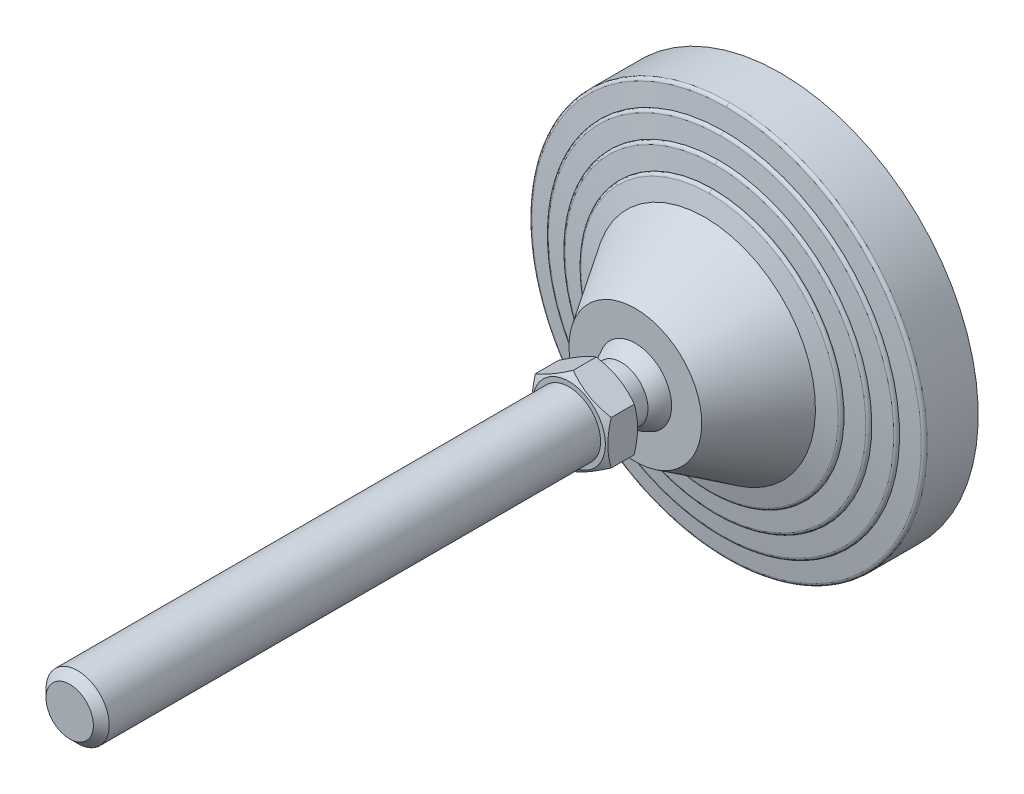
ISO-10303-21;
HEADER;
FILE_DESCRIPTION(('STEP AP214'),'2;1');
FILE_NAME('part.step','',(''),(''),'','','');
FILE_SCHEMA(('AUTOMOTIVE_DESIGN { 1 0 10303 214 1 1 1 1 }'));
ENDSEC;
DATA;
#1=APPLICATION_CONTEXT('core data for automotive mechanical design processes');
#2=APPLICATION_PROTOCOL_DEFINITION('international standard','automotive_design',2000,#1);
#3=PRODUCT_CONTEXT('',#1,'mechanical');
#4=PRODUCT('Part','Part','',(#3));
#5=PRODUCT_RELATED_PRODUCT_CATEGORY('part','',(#4));
#6=PRODUCT_DEFINITION_FORMATION('','',#4);
#7=PRODUCT_DEFINITION_CONTEXT('part definition',#1,'design');
#8=PRODUCT_DEFINITION('design','',#6,#7);
#9=PRODUCT_DEFINITION_SHAPE('','',#8);
#10=(LENGTH_UNIT() NAMED_UNIT(*) SI_UNIT(.MILLI.,.METRE.));
#11=(NAMED_UNIT(*) PLANE_ANGLE_UNIT() SI_UNIT($,.RADIAN.));
#12=(NAMED_UNIT(*) SI_UNIT($,.STERADIAN.) SOLID_ANGLE_UNIT());
#13=UNCERTAINTY_MEASURE_WITH_UNIT(LENGTH_MEASURE(1.E-05),#10,'distance_accuracy_value','');
#14=(GEOMETRIC_REPRESENTATION_CONTEXT(3) GLOBAL_UNCERTAINTY_ASSIGNED_CONTEXT((#13)) GLOBAL_UNIT_ASSIGNED_CONTEXT((#10,
#11,#12)) REPRESENTATION_CONTEXT('',''));
#15=CARTESIAN_POINT('',(0.,0.,0.));
#16=DIRECTION('',(0.,0.,1.));
#17=DIRECTION('',(1.,0.,0.));
#18=AXIS2_PLACEMENT_3D('',#15,#16,#17);
#19=CARTESIAN_POINT('',(-63.467641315,63.25,0.));
#20=DIRECTION('',(0.,0.,1.));
#21=DIRECTION('',(0.,-1.,0.));
#22=AXIS2_PLACEMENT_3D('',#19,#20,#21);
#23=PLANE('',#22);
#24=CARTESIAN_POINT('',(0.,0.,0.));
#25=DIRECTION('',(0.,0.,-1.));
#26=DIRECTION('',(0.,1.,0.));
#27=AXIS2_PLACEMENT_3D('',#24,#25,#26);
#28=CIRCLE('',#27,62.5);
#29=CARTESIAN_POINT('',(0.,62.5,0.));
#30=VERTEX_POINT('',#29);
#31=EDGE_CURVE('E243',#30,#30,#28,.F.);
#32=ORIENTED_EDGE('',*,*,#31,.F.);
#33=EDGE_LOOP('',(#32));
#34=FACE_BOUND('',#33,.T.);
#35=ADVANCED_FACE('F14',(#34),#23,.F.);
#36=CARTESIAN_POINT('',(0.,0.,16.119206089));
#37=DIRECTION('',(0.,0.,-1.));
#38=DIRECTION('',(0.,1.,0.));
#39=AXIS2_PLACEMENT_3D('',#36,#37,#38);
#40=CYLINDRICAL_SURFACE('',#39,62.5);
#41=ORIENTED_EDGE('',*,*,#31,.T.);
#42=EDGE_LOOP('',(#41));
#43=FACE_BOUND('',#42,.T.);
#44=CARTESIAN_POINT('',(0.,0.,16.119206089));
#45=DIRECTION('',(0.,0.,1.));
#46=DIRECTION('',(0.,-1.,0.));
#47=AXIS2_PLACEMENT_3D('',#44,#45,#46);
#48=CIRCLE('',#47,62.5);
#49=CARTESIAN_POINT('',(-6.40950451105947E-09,-62.5,16.119206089));
#50=VERTEX_POINT('',#49);
#51=CARTESIAN_POINT('',(0.,62.5,16.119206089));
#52=VERTEX_POINT('',#51);
#53=EDGE_CURVE('E522',#50,#52,#48,.T.);
#54=ORIENTED_EDGE('',*,*,#53,.F.);
#55=CARTESIAN_POINT('',(0.,0.,16.119206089));
#56=DIRECTION('',(0.,0.,1.));
#57=DIRECTION('',(0.,-1.,0.));
#58=AXIS2_PLACEMENT_3D('',#55,#56,#57);
#59=CIRCLE('',#58,62.5);
#60=EDGE_CURVE('E245',#52,#50,#59,.T.);
#61=ORIENTED_EDGE('',*,*,#60,.F.);
#62=EDGE_LOOP('',(#54,#61));
#63=FACE_BOUND('',#62,.T.);
#64=ADVANCED_FACE('F387',(#43,#63),#40,.T.);
#65=CARTESIAN_POINT('',(0.,-62.5,16.119206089));
#66=CARTESIAN_POINT('',(-125.,-62.5,16.1192060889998));
#67=CARTESIAN_POINT('',(-125.,62.5,16.1192060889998));
#68=CARTESIAN_POINT('',(0.,62.5,16.119206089));
#69=CARTESIAN_POINT('',(0.,-62.5000000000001,16.647800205));
#70=CARTESIAN_POINT('',(-125.,-62.5,16.6478002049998));
#71=CARTESIAN_POINT('',(-125.,62.5,16.6478002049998));
#72=CARTESIAN_POINT('',(0.,62.5000000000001,16.647800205));
#73=CARTESIAN_POINT('',(0.,-62.150618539,17.044466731));
#74=CARTESIAN_POINT('',(-124.301237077,-62.1506185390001,17.0444667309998));
#75=CARTESIAN_POINT('',(-124.301237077,62.1506185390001,17.0444667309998));
#76=CARTESIAN_POINT('',(0.,62.150618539,17.044466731));
#77=CARTESIAN_POINT('',(0.,-61.62625428,17.111204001));
#78=CARTESIAN_POINT('',(-123.252508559,-61.6262542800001,17.1112040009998));
#79=CARTESIAN_POINT('',(-123.252508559,61.6262542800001,17.1112040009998));
#80=CARTESIAN_POINT('',(0.,61.62625428,17.111204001));
#81=(BOUNDED_SURFACE() B_SPLINE_SURFACE(3,3,((#65,#66,#67,#68),(#69,#70,#71,#72),(#73,#74,#75,
#76),(#77,#78,#79,#80)),.UNSPECIFIED.,.F.,.F.,.F.) B_SPLINE_SURFACE_WITH_KNOTS((4,4),(4,4),(0.,
1.),(0.,1.),.UNSPECIFIED.) GEOMETRIC_REPRESENTATION_ITEM() RATIONAL_B_SPLINE_SURFACE(((1.,
0.333333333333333,0.333333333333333,1.),(0.833611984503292,0.277870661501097,0.277870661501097,
0.833611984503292),(0.833611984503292,0.277870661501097,0.277870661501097,0.833611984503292),
(1.,0.333333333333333,0.333333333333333,1.))) REPRESENTATION_ITEM('') SURFACE());
#82=CARTESIAN_POINT('',(0.,62.5,16.119206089));
#83=CARTESIAN_POINT('',(0.,62.5000000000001,16.647800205));
#84=CARTESIAN_POINT('',(0.,62.150618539,17.044466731));
#85=CARTESIAN_POINT('',(0.,61.62625428,17.111204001));
#86=(BOUNDED_CURVE() B_SPLINE_CURVE(3,(#82,#83,#84,#85),.UNSPECIFIED.,.F.,
.F.) B_SPLINE_CURVE_WITH_KNOTS((4,4),(0.,1.),
.UNSPECIFIED.) CURVE() GEOMETRIC_REPRESENTATION_ITEM() RATIONAL_B_SPLINE_CURVE((1.,
0.833611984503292,0.833611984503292,1.)) REPRESENTATION_ITEM(''));
#87=CARTESIAN_POINT('',(0.,61.6262542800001,17.111204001));
#88=VERTEX_POINT('',#87);
#89=EDGE_CURVE('E513',#52,#88,#86,.T.);
#90=CARTESIAN_POINT('',(0.,-62.5,16.119206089));
#91=CARTESIAN_POINT('',(0.,-62.5000000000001,16.647800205));
#92=CARTESIAN_POINT('',(0.,-62.150618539,17.044466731));
#93=CARTESIAN_POINT('',(0.,-61.62625428,17.111204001));
#94=(BOUNDED_CURVE() B_SPLINE_CURVE(3,(#90,#91,#92,#93),.UNSPECIFIED.,.F.,
.F.) B_SPLINE_CURVE_WITH_KNOTS((4,4),(0.,1.),
.UNSPECIFIED.) CURVE() GEOMETRIC_REPRESENTATION_ITEM() RATIONAL_B_SPLINE_CURVE((1.,
0.833611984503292,0.833611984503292,1.)) REPRESENTATION_ITEM(''));
#95=CARTESIAN_POINT('',(-1.89596578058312E-08,-61.6262542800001,17.111204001));
#96=VERTEX_POINT('',#95);
#97=EDGE_CURVE('E248',#96,#50,#94,.F.);
#98=CARTESIAN_POINT('',(0.,0.,17.111204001));
#99=DIRECTION('',(0.,0.,-1.));
#100=DIRECTION('',(0.,1.,0.));
#101=AXIS2_PLACEMENT_3D('',#98,#99,#100);
#102=CIRCLE('',#101,61.62625428);
#103=EDGE_CURVE('E506',#88,#96,#102,.F.);
#104=ORIENTED_EDGE('',*,*,#89,.F.);
#105=ORIENTED_EDGE('',*,*,#60,.T.);
#106=ORIENTED_EDGE('',*,*,#97,.F.);
#107=ORIENTED_EDGE('',*,*,#103,.F.);
#108=EDGE_LOOP('',(#104,#105,#106,#107));
#109=FACE_BOUND('',#108,.T.);
#110=ADVANCED_FACE('F693',(#109),#81,.T.);
#111=CARTESIAN_POINT('',(0.,62.5,16.119206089));
#112=CARTESIAN_POINT('',(125.,62.5,16.1192060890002));
#113=CARTESIAN_POINT('',(125.,-62.5,16.1192060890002));
#114=CARTESIAN_POINT('',(0.,-62.5,16.119206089));
#115=CARTESIAN_POINT('',(0.,62.5000000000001,16.647800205));
#116=CARTESIAN_POINT('',(125.,62.5,16.6478002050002));
#117=CARTESIAN_POINT('',(125.,-62.5,16.6478002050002));
#118=CARTESIAN_POINT('',(0.,-62.5000000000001,16.647800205));
#119=CARTESIAN_POINT('',(0.,62.150618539,17.044466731));
#120=CARTESIAN_POINT('',(124.301237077,62.1506185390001,17.0444667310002));
#121=CARTESIAN_POINT('',(124.301237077,-62.1506185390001,17.0444667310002));
#122=CARTESIAN_POINT('',(0.,-62.150618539,17.044466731));
#123=CARTESIAN_POINT('',(0.,61.62625428,17.111204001));
#124=CARTESIAN_POINT('',(123.252508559,61.6262542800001,17.1112040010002));
#125=CARTESIAN_POINT('',(123.252508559,-61.6262542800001,17.1112040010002));
#126=CARTESIAN_POINT('',(0.,-61.62625428,17.111204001));
#127=(BOUNDED_SURFACE() B_SPLINE_SURFACE(3,3,((#111,#112,#113,#114),(#115,#116,#117,#118),(#119,
#120,#121,#122),(#123,#124,#125,#126)),.UNSPECIFIED.,.F.,.F.,
.F.) B_SPLINE_SURFACE_WITH_KNOTS((4,4),(4,4),(0.,1.),(0.,1.),
.UNSPECIFIED.) GEOMETRIC_REPRESENTATION_ITEM() RATIONAL_B_SPLINE_SURFACE(((1.,0.333333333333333,
0.333333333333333,1.),(0.833611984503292,0.277870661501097,0.277870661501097,0.833611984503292),
(0.833611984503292,0.277870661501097,0.277870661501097,0.833611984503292),(1.,0.333333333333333,
0.333333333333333,1.))) REPRESENTATION_ITEM('') SURFACE());
#128=CARTESIAN_POINT('',(0.,0.,17.111204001));
#129=DIRECTION('',(0.,0.,-1.));
#130=DIRECTION('',(0.,1.,0.));
#131=AXIS2_PLACEMENT_3D('',#128,#129,#130);
#132=CIRCLE('',#131,61.62625428);
#133=EDGE_CURVE('E512',#96,#88,#132,.F.);
#134=ORIENTED_EDGE('',*,*,#53,.T.);
#135=ORIENTED_EDGE('',*,*,#89,.T.);
#136=ORIENTED_EDGE('',*,*,#133,.F.);
#137=ORIENTED_EDGE('',*,*,#97,.T.);
#138=EDGE_LOOP('',(#134,#135,#136,#137));
#139=FACE_BOUND('',#138,.T.);
#140=ADVANCED_FACE('F229',(#139),#127,.T.);
#141=CARTESIAN_POINT('',(0.,0.,17.890909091));
#142=DIRECTION('',(0.,0.,-1.));
#143=DIRECTION('',(0.,1.,0.));
#144=AXIS2_PLACEMENT_3D('',#141,#142,#143);
#145=CONICAL_SURFACE('',#144,55.5,1.44420419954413);
#146=ORIENTED_EDGE('',*,*,#103,.T.);
#147=ORIENTED_EDGE('',*,*,#133,.T.);
#148=EDGE_LOOP('',(#146,#147));
#149=FACE_BOUND('',#148,.T.);
#150=CARTESIAN_POINT('',(-1.13831206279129E-08,-55.5,17.890909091));
#151=CARTESIAN_POINT('',(0.666810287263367,-55.5000058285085,17.890909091));
#152=CARTESIAN_POINT('',(1.33362158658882,-55.4879831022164,17.890909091));
#153=CARTESIAN_POINT('',(2.66828219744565,-55.4398527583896,17.890909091));
#154=CARTESIAN_POINT('',(3.33612903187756,-55.4036764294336,17.890909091));
#155=CARTESIAN_POINT('',(4.67008368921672,-55.3072108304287,17.890909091));
#156=CARTESIAN_POINT('',(5.33619149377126,-55.2469213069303,17.890909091));
#157=CARTESIAN_POINT('',(6.66630694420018,-55.1022519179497,17.890909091));
#158=CARTESIAN_POINT('',(7.3303126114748,-55.0178537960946,17.890909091));
#159=CARTESIAN_POINT('',(8.65488946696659,-54.8250946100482,17.890909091));
#160=CARTESIAN_POINT('',(9.3154601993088,-54.7167304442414,17.890909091));
#161=CARTESIAN_POINT('',(11.3032442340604,-54.3535835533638,17.890909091));
#162=CARTESIAN_POINT('',(12.6239565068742,-54.0621103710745,17.890909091));
#163=CARTESIAN_POINT('',(15.2407929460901,-53.383483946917,17.890909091));
#164=CARTESIAN_POINT('',(16.536910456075,-52.9963051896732,17.890909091));
#165=CARTESIAN_POINT('',(19.0989356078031,-52.1278427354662,17.890909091));
#166=CARTESIAN_POINT('',(20.3648068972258,-51.6464516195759,17.890909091));
#167=CARTESIAN_POINT('',(22.8579438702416,-50.5924539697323,17.890909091));
#168=CARTESIAN_POINT('',(24.0852091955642,-50.0198465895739,17.890909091));
#169=CARTESIAN_POINT('',(26.6786676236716,-48.6922162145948,17.8909090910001));
#170=CARTESIAN_POINT('',(28.037466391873,-47.9226902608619,17.890909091));
#171=CARTESIAN_POINT('',(30.6855194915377,-46.2718474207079,17.890909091));
#172=CARTESIAN_POINT('',(31.974765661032,-45.3905174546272,17.890909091));
#173=CARTESIAN_POINT('',(34.4745529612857,-43.5222940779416,17.890909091));
#174=CARTESIAN_POINT('',(35.6850872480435,-42.5353915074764,17.890909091));
#175=CARTESIAN_POINT('',(38.0186685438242,-40.4631409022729,17.890909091));
#176=CARTESIAN_POINT('',(39.1417181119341,-39.3777957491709,17.8909090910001));
#177=CARTESIAN_POINT('',(41.292347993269,-37.1163936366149,17.8909090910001));
#178=CARTESIAN_POINT('',(42.3199319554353,-35.9403401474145,17.8909090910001));
#179=CARTESIAN_POINT('',(44.2723789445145,-33.5058382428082,17.8909090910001));
#180=CARTESIAN_POINT('',(45.1972412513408,-32.2473892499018,17.8909090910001));
#181=CARTESIAN_POINT('',(46.937631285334,-29.6570957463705,17.8909090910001));
#182=CARTESIAN_POINT('',(47.7531628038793,-28.3252537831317,17.8909090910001));
#183=CARTESIAN_POINT('',(49.2691299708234,-25.5976050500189,17.8909090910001));
#184=CARTESIAN_POINT('',(49.9695658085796,-24.2017983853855,17.8909090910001));
#185=CARTESIAN_POINT('',(51.2503706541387,-21.3561258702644,17.8909090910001));
#186=CARTESIAN_POINT('',(51.83073836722,-19.9062594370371,17.8909090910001));
#187=CARTESIAN_POINT('',(52.8672716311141,-16.9627885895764,17.8909090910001));
#188=CARTESIAN_POINT('',(53.3234371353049,-15.4691841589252,17.8909090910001));
#189=CARTESIAN_POINT('',(54.1083272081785,-12.448838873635,17.8909090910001));
#190=CARTESIAN_POINT('',(54.4370503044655,-10.9220976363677,17.8909090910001));
#191=CARTESIAN_POINT('',(54.9647110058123,-7.84634988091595,17.8909090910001));
#192=CARTESIAN_POINT('',(55.1636486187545,-6.29734336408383,17.8909090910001));
#193=CARTESIAN_POINT('',(55.4303245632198,-3.1880715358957,17.8909090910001));
#194=CARTESIAN_POINT('',(55.4980623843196,-1.62780618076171,17.8909090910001));
#195=CARTESIAN_POINT('',(55.5018556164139,1.49288460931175,17.8909090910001));
#196=CARTESIAN_POINT('',(55.4379110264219,3.05331004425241,17.8909090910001));
#197=CARTESIAN_POINT('',(55.1787965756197,6.16319684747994,17.8909090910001));
#198=CARTESIAN_POINT('',(54.9836292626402,7.71265842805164,17.8909090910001));
#199=CARTESIAN_POINT('',(54.4634594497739,10.7896325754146,17.8909090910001));
#200=CARTESIAN_POINT('',(54.1384569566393,12.3171451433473,17.8909090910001));
#201=CARTESIAN_POINT('',(53.3609336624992,15.3393372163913,17.8909090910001));
#202=CARTESIAN_POINT('',(52.9084149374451,16.8340172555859,17.8909090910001));
#203=CARTESIAN_POINT('',(51.8790738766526,19.7799443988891,17.8909090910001));
#204=CARTESIAN_POINT('',(51.3022515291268,21.231191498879,17.8909090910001));
#205=CARTESIAN_POINT('',(50.0283709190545,24.0800097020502,17.8909090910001));
#206=CARTESIAN_POINT('',(49.3313064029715,25.4775780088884,17.8909090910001));
#207=CARTESIAN_POINT('',(47.8219174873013,28.2090226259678,17.8909090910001));
#208=CARTESIAN_POINT('',(47.0095931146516,29.5428989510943,17.8909090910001));
#209=CARTESIAN_POINT('',(45.2754391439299,32.1375097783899,17.8909090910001));
#210=CARTESIAN_POINT('',(44.3536065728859,33.3982422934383,17.8909090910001));
#211=CARTESIAN_POINT('',(42.4069961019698,35.8375708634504,17.8909090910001));
#212=CARTESIAN_POINT('',(41.3822180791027,37.0161668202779,17.8909090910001));
#213=CARTESIAN_POINT('',(39.2371577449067,39.2826945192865,17.890909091));
#214=CARTESIAN_POINT('',(38.1168855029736,40.370635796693,17.890909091));
#215=CARTESIAN_POINT('',(35.7885615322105,42.4483529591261,17.890909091));
#216=CARTESIAN_POINT('',(34.5805102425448,43.4381293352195,17.8909090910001));
#217=CARTESIAN_POINT('',(32.5014047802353,44.9999063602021,17.890909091));
#218=CARTESIAN_POINT('',(31.6521856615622,45.6012216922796,17.890909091));
#219=CARTESIAN_POINT('',(29.921241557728,46.7552239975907,17.890909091));
#220=CARTESIAN_POINT('',(29.0395163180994,47.3079105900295,17.890909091));
#221=CARTESIAN_POINT('',(27.246397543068,48.3628576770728,17.890909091));
#222=CARTESIAN_POINT('',(26.3350034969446,48.8651173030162,17.890909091));
#223=CARTESIAN_POINT('',(24.4853750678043,49.8176528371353,17.890909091));
#224=CARTESIAN_POINT('',(23.5471392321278,50.2679259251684,17.890909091));
#225=CARTESIAN_POINT('',(21.6468644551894,51.1150215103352,17.890909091));
#226=CARTESIAN_POINT('',(20.6848259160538,51.5118449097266,17.890909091));
#227=CARTESIAN_POINT('',(18.7400290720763,52.250772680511,17.890909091));
#228=CARTESIAN_POINT('',(17.7572723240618,52.5928811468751,17.890909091));
#229=CARTESIAN_POINT('',(15.863617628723,53.1929617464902,17.890909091));
#230=CARTESIAN_POINT('',(14.9542390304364,53.4557406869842,17.890909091));
#231=CARTESIAN_POINT('',(13.123285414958,53.9344479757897,17.890909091));
#232=CARTESIAN_POINT('',(12.2017111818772,54.1503793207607,17.890909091));
#233=CARTESIAN_POINT('',(10.3487557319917,54.5348378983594,17.890909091));
#234=CARTESIAN_POINT('',(9.41737477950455,54.7033664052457,17.890909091));
#235=CARTESIAN_POINT('',(7.54728204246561,54.9925789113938,17.890909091));
#236=CARTESIAN_POINT('',(6.60857079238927,55.1132663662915,17.890909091));
#237=CARTESIAN_POINT('',(4.72616569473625,55.3064952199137,17.890909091));
#238=CARTESIAN_POINT('',(3.78247163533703,55.3790345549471,17.890909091));
#239=CARTESIAN_POINT('',(1.89251924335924,55.4758006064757,17.890909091));
#240=CARTESIAN_POINT('',(0.946260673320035,55.5000226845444,17.890909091));
#241=CARTESIAN_POINT('',(-1.6611884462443E-09,55.5,17.890909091));
#242=B_SPLINE_CURVE_WITH_KNOTS('',3,(#150,#151,#152,#153,#154,#155,#156,#157,#158,#159,#160,
#161,#162,#163,#164,#165,#166,#167,#168,#169,#170,#171,#172,#173,#174,#175,#176,#177,#178,#179,
#180,#181,#182,#183,#184,#185,#186,#187,#188,#189,#190,#191,#192,#193,#194,#195,#196,#197,#198,
#199,#200,#201,#202,#203,#204,#205,#206,#207,#208,#209,#210,#211,#212,#213,#214,#215,#216,#217,
#218,#219,#220,#221,#222,#223,#224,#225,#226,#227,#228,#229,#230,#231,#232,#233,#234,#235,#236,
#237,#238,#239,#240,#241),.UNSPECIFIED.,.F.,.F.,(4,2,2,2,2,2,2,2,2,2,2,2,2,2,2,2,2,2,2,2,2,2,2,
2,2,2,2,2,2,2,2,2,2,2,2,2,2,2,2,2,2,2,2,2,2,4),(0.,2.00032482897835,4.00636450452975,
6.01242526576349,8.02000917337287,10.0278530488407,14.0813911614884,18.1360111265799,
22.1952813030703,26.2545891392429,30.9336173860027,35.6131935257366,40.2931760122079,
44.9730215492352,49.6526881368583,54.332387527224,59.0119245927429,63.6914539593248,
68.3710337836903,73.0506153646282,77.730251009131,82.4098863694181,87.0895399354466,
91.7691935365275,96.4487562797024,101.128318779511,105.807805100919,110.487291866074,
115.167022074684,119.846751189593,124.526607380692,129.206469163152,133.885838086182,
138.565183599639,141.685351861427,144.805544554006,147.925790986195,151.046206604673,
154.16656954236,157.286698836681,160.12523673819,162.963593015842,165.801872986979,
168.639947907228,171.478144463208,174.316613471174),.UNSPECIFIED.);
#243=CARTESIAN_POINT('',(-1.13832569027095E-08,-55.5,17.895966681));
#244=VERTEX_POINT('',#243);
#245=CARTESIAN_POINT('',(-1.66120696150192E-09,55.5,17.895966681));
#246=VERTEX_POINT('',#245);
#247=EDGE_CURVE('E210',#244,#246,#242,.T.);
#248=ORIENTED_EDGE('',*,*,#247,.F.);
#249=CARTESIAN_POINT('',(-1.66120468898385E-09,55.5,17.890909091));
#250=CARTESIAN_POINT('',(-0.666810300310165,55.5000058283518,17.890909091));
#251=CARTESIAN_POINT('',(-1.33362159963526,55.4879831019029,17.890909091));
#252=CARTESIAN_POINT('',(-2.66828221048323,55.4398527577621,17.890909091));
#253=CARTESIAN_POINT('',(-3.33612904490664,55.403676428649,17.890909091));
#254=CARTESIAN_POINT('',(-4.67008370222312,55.3072108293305,17.890909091));
#255=CARTESIAN_POINT('',(-5.33619150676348,55.2469213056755,17.890909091));
#256=CARTESIAN_POINT('',(-6.66630695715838,55.1022519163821,17.890909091));
#257=CARTESIAN_POINT('',(-7.33031262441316,55.0178537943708,17.890909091));
#258=CARTESIAN_POINT('',(-8.65488947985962,54.8250946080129,17.890909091));
#259=CARTESIAN_POINT('',(-9.31546021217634,54.7167304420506,17.890909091));
#260=CARTESIAN_POINT('',(-11.3032442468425,54.3535835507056,17.890909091));
#261=CARTESIAN_POINT('',(-12.6239565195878,54.0621103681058,17.890909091));
#262=CARTESIAN_POINT('',(-15.2407929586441,53.3834839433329,17.890909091));
#263=CARTESIAN_POINT('',(-16.5369104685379,52.9963051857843,17.890909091));
#264=CARTESIAN_POINT('',(-19.0989356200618,52.1278427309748,17.890909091));
#265=CARTESIAN_POINT('',(-20.3648069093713,51.6464516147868,17.890909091));
#266=CARTESIAN_POINT('',(-22.8579438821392,50.5924539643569,17.890909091));
#267=CARTESIAN_POINT('',(-24.0852092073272,50.0198465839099,17.890909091));
#268=CARTESIAN_POINT('',(-26.6786676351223,48.6922162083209,17.8909090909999));
#269=CARTESIAN_POINT('',(-28.0374664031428,47.9226902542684,17.890909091));
#270=CARTESIAN_POINT('',(-30.6855195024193,46.2718474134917,17.890909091));
#271=CARTESIAN_POINT('',(-31.9747656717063,45.3905174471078,17.890909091));
#272=CARTESIAN_POINT('',(-34.4745529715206,43.5222940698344,17.8909090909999));
#273=CARTESIAN_POINT('',(-35.6850872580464,42.5353914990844,17.8909090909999));
#274=CARTESIAN_POINT('',(-38.0186685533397,40.4631408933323,17.8909090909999));
#275=CARTESIAN_POINT('',(-39.1417181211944,39.3777957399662,17.890909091));
#276=CARTESIAN_POINT('',(-41.2923480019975,37.1163936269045,17.8909090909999));
#277=CARTESIAN_POINT('',(-42.3199319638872,35.9403401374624,17.8909090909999));
#278=CARTESIAN_POINT('',(-44.2723789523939,33.5058382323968,17.8909090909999));
#279=CARTESIAN_POINT('',(-45.1972412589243,32.247389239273,17.8909090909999));
#280=CARTESIAN_POINT('',(-46.9376312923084,29.6570957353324,17.8909090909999));
#281=CARTESIAN_POINT('',(-47.7531628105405,28.3252537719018,17.8909090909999));
#282=CARTESIAN_POINT('',(-49.2691299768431,25.5976050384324,17.8909090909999));
#283=CARTESIAN_POINT('',(-49.9695658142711,24.2017983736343,17.890909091));
#284=CARTESIAN_POINT('',(-51.250370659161,21.3561258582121,17.890909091));
#285=CARTESIAN_POINT('',(-51.8307383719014,19.9062594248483,17.8909090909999));
#286=CARTESIAN_POINT('',(-52.8672716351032,16.9627885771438,17.8909090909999));
#287=CARTESIAN_POINT('',(-53.3234371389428,15.4691841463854,17.8909090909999));
#288=CARTESIAN_POINT('',(-54.1083272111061,12.4488388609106,17.8909090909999));
#289=CARTESIAN_POINT('',(-54.437050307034,10.9220976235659,17.8909090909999));
#290=CARTESIAN_POINT('',(-54.9647110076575,7.8463498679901,17.8909090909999));
#291=CARTESIAN_POINT('',(-55.1636486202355,6.29734335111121,17.8909090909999));
#292=CARTESIAN_POINT('',(-55.4303245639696,3.18807152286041,17.8909090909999));
#293=CARTESIAN_POINT('',(-55.4980623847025,1.6278061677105,17.8909090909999));
#294=CARTESIAN_POINT('',(-55.5018556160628,-1.49288462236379,17.8909090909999));
#295=CARTESIAN_POINT('',(-55.4379110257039,-3.05331005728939,17.8909090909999));
#296=CARTESIAN_POINT('',(-55.1787965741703,-6.16319686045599,17.8909090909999));
#297=CARTESIAN_POINT('',(-54.9836292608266,-7.71265844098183,17.8909090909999));
#298=CARTESIAN_POINT('',(-54.4634594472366,-10.7896325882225,17.8909090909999));
#299=CARTESIAN_POINT('',(-54.1384569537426,-12.3171451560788,17.8909090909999));
#300=CARTESIAN_POINT('',(-53.3609336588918,-15.3393372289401,17.890909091));
#301=CARTESIAN_POINT('',(-52.9084149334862,-16.8340172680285,17.8909090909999));
#302=CARTESIAN_POINT('',(-51.8790738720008,-19.7799444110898,17.8909090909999));
#303=CARTESIAN_POINT('',(-51.3022515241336,-21.2311915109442,17.8909090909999));
#304=CARTESIAN_POINT('',(-50.0283709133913,-24.0800097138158,17.8909090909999));
#305=CARTESIAN_POINT('',(-49.3313063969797,-25.47757802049,17.8909090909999));
#306=CARTESIAN_POINT('',(-47.8219174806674,-28.2090226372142,17.8909090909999));
#307=CARTESIAN_POINT('',(-47.009593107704,-29.5428989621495,17.890909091));
#308=CARTESIAN_POINT('',(-45.2754391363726,-32.1375097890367,17.890909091));
#309=CARTESIAN_POINT('',(-44.3536065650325,-33.3982423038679,17.8909090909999));
#310=CARTESIAN_POINT('',(-42.4069960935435,-35.8375708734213,17.8909090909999));
#311=CARTESIAN_POINT('',(-41.3822180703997,-37.0161668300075,17.8909090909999));
#312=CARTESIAN_POINT('',(-39.2371577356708,-39.2826945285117,17.8909090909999));
#313=CARTESIAN_POINT('',(-38.1168854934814,-40.3706358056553,17.890909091));
#314=CARTESIAN_POINT('',(-35.788561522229,-42.4483529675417,17.890909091));
#315=CARTESIAN_POINT('',(-34.5805102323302,-43.4381293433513,17.890909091));
#316=CARTESIAN_POINT('',(-32.501404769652,-44.9999063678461,17.890909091));
#317=CARTESIAN_POINT('',(-31.6521856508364,-45.6012216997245,17.890909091));
#318=CARTESIAN_POINT('',(-29.9212415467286,-46.7552240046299,17.890909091));
#319=CARTESIAN_POINT('',(-29.0395163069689,-47.3079105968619,17.890909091));
#320=CARTESIAN_POINT('',(-27.2463975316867,-48.3628576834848,17.890909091));
#321=CARTESIAN_POINT('',(-26.3350034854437,-48.8651173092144,17.890909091));
#322=CARTESIAN_POINT('',(-24.4853750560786,-49.8176528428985,17.890909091));
#323=CARTESIAN_POINT('',(-23.5471392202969,-50.2679259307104,17.890909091));
#324=CARTESIAN_POINT('',(-21.646864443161,-51.1150215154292,17.890909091));
#325=CARTESIAN_POINT('',(-20.6848259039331,-51.5118449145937,17.890909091));
#326=CARTESIAN_POINT('',(-18.7400290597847,-52.2507726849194,17.890909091));
#327=CARTESIAN_POINT('',(-17.7572723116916,-52.5928811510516,17.890909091));
#328=CARTESIAN_POINT('',(-15.8636176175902,-53.1929617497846,17.890909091));
#329=CARTESIAN_POINT('',(-14.9542390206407,-53.455740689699,17.890909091));
#330=CARTESIAN_POINT('',(-13.1232854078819,-53.9344479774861,17.890909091));
#331=CARTESIAN_POINT('',(-12.2017111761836,-54.1503793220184,17.890909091));
#332=CARTESIAN_POINT('',(-10.3487557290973,-54.5348378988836,17.890909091));
#333=CARTESIAN_POINT('',(-9.41737477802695,-54.7033664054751,17.890909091));
#334=CARTESIAN_POINT('',(-7.5472820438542,-54.9925789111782,17.890909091));
#335=CARTESIAN_POINT('',(-6.60857079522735,-55.1132663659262,17.890909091));
#336=CARTESIAN_POINT('',(-4.72616570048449,-55.3064952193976,17.890909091));
#337=CARTESIAN_POINT('',(-3.78247164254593,-55.3790345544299,17.890909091));
#338=CARTESIAN_POINT('',(-1.89251925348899,-55.4758006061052,17.890909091));
#339=CARTESIAN_POINT('',(-0.946260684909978,-55.5000226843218,17.890909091));
#340=CARTESIAN_POINT('',(-1.13832579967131E-08,-55.5,17.890909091));
#341=B_SPLINE_CURVE_WITH_KNOTS('',3,(#249,#250,#251,#252,#253,#254,#255,#256,#257,#258,#259,
#260,#261,#262,#263,#264,#265,#266,#267,#268,#269,#270,#271,#272,#273,#274,#275,#276,#277,#278,
#279,#280,#281,#282,#283,#284,#285,#286,#287,#288,#289,#290,#291,#292,#293,#294,#295,#296,#297,
#298,#299,#300,#301,#302,#303,#304,#305,#306,#307,#308,#309,#310,#311,#312,#313,#314,#315,#316,
#317,#318,#319,#320,#321,#322,#323,#324,#325,#326,#327,#328,#329,#330,#331,#332,#333,#334,#335,
#336,#337,#338,#339,#340),.UNSPECIFIED.,.F.,.F.,(4,2,2,2,2,2,2,2,2,2,2,2,2,2,2,2,2,2,2,2,2,2,2,
2,2,2,2,2,2,2,2,2,2,2,2,2,2,2,2,2,2,2,2,2,2,4),(0.,2.00032482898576,4.00636450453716,
6.0124252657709,8.02000917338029,10.0278530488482,14.0813911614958,18.1360111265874,
22.1952813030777,26.2545891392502,30.93361738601,35.613193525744,40.2931760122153,
44.9730215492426,49.6526881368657,54.3323875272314,59.0119245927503,63.6914539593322,
68.3710337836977,73.0506153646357,77.7302510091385,82.4098863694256,87.0895399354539,
91.7691935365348,96.4487562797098,101.128318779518,105.807805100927,110.487291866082,
115.167022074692,119.846751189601,124.526607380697,129.206469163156,133.885838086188,
138.565183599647,141.685351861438,144.805544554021,147.925790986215,151.04620660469,
154.166569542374,157.286698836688,160.125236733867,162.963593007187,165.801872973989,
168.639947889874,171.47814444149,174.316613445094),.UNSPECIFIED.);
#342=EDGE_CURVE('E222',#246,#244,#341,.T.);
#343=ORIENTED_EDGE('',*,*,#342,.F.);
#344=EDGE_LOOP('',(#248,#343));
#345=FACE_BOUND('',#344,.T.);
#346=ADVANCED_FACE('F224',(#149,#345),#145,.T.);
#347=CARTESIAN_POINT('',(0.,-55.5,17.887804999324));
#348=CARTESIAN_POINT('',(-111.,-55.5000000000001,17.8878049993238));
#349=CARTESIAN_POINT('',(-111.,55.5000000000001,17.8878049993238));
#350=CARTESIAN_POINT('',(0.,55.5,17.887804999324));
#351=CARTESIAN_POINT('',(0.,-55.5,17.892211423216));
#352=CARTESIAN_POINT('',(-111.,-55.5000000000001,17.8922114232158));
#353=CARTESIAN_POINT('',(-111.,55.5000000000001,17.8922114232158));
#354=CARTESIAN_POINT('',(0.,55.5,17.892211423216));
#355=CARTESIAN_POINT('',(0.,-55.5,17.896617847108));
#356=CARTESIAN_POINT('',(-111.,-55.5000000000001,17.8966178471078));
#357=CARTESIAN_POINT('',(-111.,55.5000000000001,17.8966178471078));
#358=CARTESIAN_POINT('',(0.,55.5,17.896617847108));
#359=CARTESIAN_POINT('',(0.,-55.5,17.901024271));
#360=CARTESIAN_POINT('',(-111.,-55.5000000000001,17.9010242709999));
#361=CARTESIAN_POINT('',(-111.,55.5000000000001,17.9010242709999));
#362=CARTESIAN_POINT('',(0.,55.5,17.901024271));
#363=CARTESIAN_POINT('',(0.,-55.5,18.429618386));
#364=CARTESIAN_POINT('',(-111.,-55.5000000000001,18.4296183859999));
#365=CARTESIAN_POINT('',(-111.,55.5000000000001,18.4296183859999));
#366=CARTESIAN_POINT('',(0.,55.5,18.429618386));
#367=CARTESIAN_POINT('',(0.,-55.150618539,18.826284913));
#368=CARTESIAN_POINT('',(-110.301237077,-55.1506185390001,18.8262849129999));
#369=CARTESIAN_POINT('',(-110.301237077,55.1506185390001,18.8262849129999));
#370=CARTESIAN_POINT('',(0.,55.150618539,18.826284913));
#371=CARTESIAN_POINT('',(0.,-54.62625428,18.893022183));
#372=CARTESIAN_POINT('',(-109.252508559,-54.62625428,18.8930221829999));
#373=CARTESIAN_POINT('',(-109.252508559,54.62625428,18.8930221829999));
#374=CARTESIAN_POINT('',(0.,54.62625428,18.893022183));
#375=(BOUNDED_SURFACE() B_SPLINE_SURFACE(3,3,((#347,#348,#349,#350),(#351,#352,#353,#354),(#355,
#356,#357,#358),(#359,#360,#361,#362),(#363,#364,#365,#366),(#367,#368,#369,#370),(#371,#372,
#373,#374)),.UNSPECIFIED.,.F.,.F.,.F.) B_SPLINE_SURFACE_WITH_KNOTS((4,3,4),(4,4),(-0.01,0.,1.),
(0.,1.),.UNSPECIFIED.) GEOMETRIC_REPRESENTATION_ITEM() RATIONAL_B_SPLINE_SURFACE(((1.,
0.333333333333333,0.333333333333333,1.),(1.,0.333333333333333,0.333333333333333,1.),(1.,
0.333333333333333,0.333333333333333,1.),(1.,0.333333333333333,0.333333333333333,1.),
(0.833611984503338,0.277870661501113,0.277870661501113,0.833611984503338),(0.833611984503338,
0.277870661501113,0.277870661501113,0.833611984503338),(1.,0.333333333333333,0.333333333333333,1.))) REPRESENTATION_ITEM('') SURFACE());
#376=CARTESIAN_POINT('',(0.,55.5,17.901024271));
#377=CARTESIAN_POINT('',(0.,55.5,18.429618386));
#378=CARTESIAN_POINT('',(0.,55.150618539,18.826284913));
#379=CARTESIAN_POINT('',(0.,54.62625428,18.893022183));
#380=(BOUNDED_CURVE() B_SPLINE_CURVE(3,(#376,#377,#378,#379),.UNSPECIFIED.,.F.,
.F.) B_SPLINE_CURVE_WITH_KNOTS((4,4),(0.,1.),
.UNSPECIFIED.) CURVE() GEOMETRIC_REPRESENTATION_ITEM() RATIONAL_B_SPLINE_CURVE((1.,
0.833611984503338,0.833611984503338,1.)) REPRESENTATION_ITEM(''));
#381=CARTESIAN_POINT('',(0.,54.6262542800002,18.8930221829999));
#382=VERTEX_POINT('',#381);
#383=EDGE_CURVE('E213',#246,#382,#380,.T.);
#384=CARTESIAN_POINT('',(0.,-55.5,17.901024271));
#385=CARTESIAN_POINT('',(0.,-55.5,18.429618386));
#386=CARTESIAN_POINT('',(0.,-55.150618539,18.826284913));
#387=CARTESIAN_POINT('',(0.,-54.62625428,18.893022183));
#388=(BOUNDED_CURVE() B_SPLINE_CURVE(3,(#384,#385,#386,#387),.UNSPECIFIED.,.F.,
.F.) B_SPLINE_CURVE_WITH_KNOTS((4,4),(0.,1.),
.UNSPECIFIED.) CURVE() GEOMETRIC_REPRESENTATION_ITEM() RATIONAL_B_SPLINE_CURVE((1.,
0.833611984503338,0.833611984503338,1.)) REPRESENTATION_ITEM(''));
#389=CARTESIAN_POINT('',(-1.68060742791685E-08,-54.6262542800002,18.8930221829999));
#390=VERTEX_POINT('',#389);
#391=EDGE_CURVE('E214',#390,#244,#388,.F.);
#392=CARTESIAN_POINT('',(0.,0.,18.8930221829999));
#393=DIRECTION('',(0.,0.,-1.));
#394=DIRECTION('',(0.,1.,0.));
#395=AXIS2_PLACEMENT_3D('',#392,#393,#394);
#396=CIRCLE('',#395,54.62625428);
#397=EDGE_CURVE('E478',#382,#390,#396,.F.);
#398=ORIENTED_EDGE('',*,*,#383,.F.);
#399=ORIENTED_EDGE('',*,*,#342,.T.);
#400=ORIENTED_EDGE('',*,*,#391,.F.);
#401=ORIENTED_EDGE('',*,*,#397,.F.);
#402=EDGE_LOOP('',(#398,#399,#400,#401));
#403=FACE_BOUND('',#402,.T.);
#404=ADVANCED_FACE('F228',(#403),#375,.T.);
#405=CARTESIAN_POINT('',(0.,55.5,17.887804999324));
#406=CARTESIAN_POINT('',(111.,55.5000000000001,17.8878049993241));
#407=CARTESIAN_POINT('',(111.,-55.5000000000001,17.8878049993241));
#408=CARTESIAN_POINT('',(0.,-55.5,17.887804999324));
#409=CARTESIAN_POINT('',(0.,55.5,17.892211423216));
#410=CARTESIAN_POINT('',(111.,55.5000000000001,17.8922114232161));
#411=CARTESIAN_POINT('',(111.,-55.5000000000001,17.8922114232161));
#412=CARTESIAN_POINT('',(0.,-55.5,17.892211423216));
#413=CARTESIAN_POINT('',(0.,55.5,17.896617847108));
#414=CARTESIAN_POINT('',(111.,55.5000000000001,17.8966178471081));
#415=CARTESIAN_POINT('',(111.,-55.5000000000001,17.8966178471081));
#416=CARTESIAN_POINT('',(0.,-55.5,17.896617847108));
#417=CARTESIAN_POINT('',(0.,55.5,17.901024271));
#418=CARTESIAN_POINT('',(111.,55.5000000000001,17.9010242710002));
#419=CARTESIAN_POINT('',(111.,-55.5000000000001,17.9010242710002));
#420=CARTESIAN_POINT('',(0.,-55.5,17.901024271));
#421=CARTESIAN_POINT('',(0.,55.5,18.429618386));
#422=CARTESIAN_POINT('',(111.,55.5000000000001,18.4296183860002));
#423=CARTESIAN_POINT('',(111.,-55.5000000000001,18.4296183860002));
#424=CARTESIAN_POINT('',(0.,-55.5,18.429618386));
#425=CARTESIAN_POINT('',(0.,55.150618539,18.826284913));
#426=CARTESIAN_POINT('',(110.301237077,55.1506185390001,18.8262849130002));
#427=CARTESIAN_POINT('',(110.301237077,-55.1506185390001,18.8262849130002));
#428=CARTESIAN_POINT('',(0.,-55.150618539,18.826284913));
#429=CARTESIAN_POINT('',(0.,54.62625428,18.893022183));
#430=CARTESIAN_POINT('',(109.252508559,54.62625428,18.8930221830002));
#431=CARTESIAN_POINT('',(109.252508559,-54.62625428,18.8930221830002));
#432=CARTESIAN_POINT('',(0.,-54.62625428,18.893022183));
#433=(BOUNDED_SURFACE() B_SPLINE_SURFACE(3,3,((#405,#406,#407,#408),(#409,#410,#411,#412),(#413,
#414,#415,#416),(#417,#418,#419,#420),(#421,#422,#423,#424),(#425,#426,#427,#428),(#429,#430,
#431,#432)),.UNSPECIFIED.,.F.,.F.,.F.) B_SPLINE_SURFACE_WITH_KNOTS((4,3,4),(4,4),(-0.01,0.,1.),
(0.,1.),.UNSPECIFIED.) GEOMETRIC_REPRESENTATION_ITEM() RATIONAL_B_SPLINE_SURFACE(((1.,
0.333333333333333,0.333333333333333,1.),(1.,0.333333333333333,0.333333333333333,1.),(1.,
0.333333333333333,0.333333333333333,1.),(1.,0.333333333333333,0.333333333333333,1.),
(0.833611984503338,0.277870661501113,0.277870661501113,0.833611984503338),(0.833611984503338,
0.277870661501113,0.277870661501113,0.833611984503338),(1.,0.333333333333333,0.333333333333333,1.))) REPRESENTATION_ITEM('') SURFACE());
#434=CARTESIAN_POINT('',(0.,0.,18.8930221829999));
#435=DIRECTION('',(0.,0.,-1.));
#436=DIRECTION('',(0.,1.,0.));
#437=AXIS2_PLACEMENT_3D('',#434,#435,#436);
#438=CIRCLE('',#437,54.62625428);
#439=EDGE_CURVE('E484',#390,#382,#438,.F.);
#440=ORIENTED_EDGE('',*,*,#247,.T.);
#441=ORIENTED_EDGE('',*,*,#383,.T.);
#442=ORIENTED_EDGE('',*,*,#439,.F.);
#443=ORIENTED_EDGE('',*,*,#391,.T.);
#444=EDGE_LOOP('',(#440,#441,#442,#443));
#445=FACE_BOUND('',#444,.T.);
#446=ADVANCED_FACE('F194',(#445),#433,.T.);
#447=CARTESIAN_POINT('',(0.,0.,19.672727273));
#448=DIRECTION('',(0.,0.,-1.));
#449=DIRECTION('',(0.,1.,0.));
#450=AXIS2_PLACEMENT_3D('',#447,#448,#449);
#451=CONICAL_SURFACE('',#450,48.5,1.44420419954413);
#452=ORIENTED_EDGE('',*,*,#397,.T.);
#453=ORIENTED_EDGE('',*,*,#439,.T.);
#454=EDGE_LOOP('',(#452,#453));
#455=FACE_BOUND('',#454,.T.);
#456=CARTESIAN_POINT('',(-9.94739578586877E-09,-48.5,19.672727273));
#457=CARTESIAN_POINT('',(0.333415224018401,-48.4999999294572,19.672727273));
#458=CARTESIAN_POINT('',(0.666820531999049,-48.4965617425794,19.672727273));
#459=CARTESIAN_POINT('',(1.33352786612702,-48.4828103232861,19.672727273));
#460=CARTESIAN_POINT('',(1.66682987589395,-48.4724962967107,19.672727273));
#461=CARTESIAN_POINT('',(2.66872204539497,-48.4311451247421,19.672727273));
#462=CARTESIAN_POINT('',(3.3369127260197,-48.3896987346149,19.672727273));
#463=CARTESIAN_POINT('',(4.67104276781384,-48.2791827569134,19.672727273));
#464=CARTESIAN_POINT('',(5.33698191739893,-48.2101106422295,19.672727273));
#465=CARTESIAN_POINT('',(6.66612914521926,-48.0443714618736,19.672727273));
#466=CARTESIAN_POINT('',(7.32933372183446,-47.9476761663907,19.672727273));
#467=CARTESIAN_POINT('',(8.65121670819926,-47.7268868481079,19.672727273));
#468=CARTESIAN_POINT('',(9.30989445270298,-47.6027888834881,19.672727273));
#469=CARTESIAN_POINT('',(11.2942742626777,-47.1861322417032,19.672727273));
#470=CARTESIAN_POINT('',(12.6113745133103,-46.8513167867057,19.672727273));
#471=CARTESIAN_POINT('',(15.2131663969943,-46.0722804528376,19.672727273));
#472=CARTESIAN_POINT('',(16.4978453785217,-45.6280175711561,19.672727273));
#473=CARTESIAN_POINT('',(19.0268967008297,-44.6326754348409,19.672727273));
#474=CARTESIAN_POINT('',(20.2712210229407,-44.0814740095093,19.672727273));
#475=CARTESIAN_POINT('',(22.7090353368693,-42.8765478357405,19.672727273));
#476=CARTESIAN_POINT('',(23.9025301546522,-42.2228328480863,19.672727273));
#477=CARTESIAN_POINT('',(26.2339069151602,-40.8153372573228,19.672727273));
#478=CARTESIAN_POINT('',(27.3716102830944,-40.0612608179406,19.672727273));
#479=CARTESIAN_POINT('',(29.5794657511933,-38.4599142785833,19.672727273));
#480=CARTESIAN_POINT('',(30.6496160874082,-37.6126417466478,19.672727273));
#481=CARTESIAN_POINT('',(32.7144313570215,-35.831197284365,19.672727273));
#482=CARTESIAN_POINT('',(33.7091176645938,-34.8970501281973,19.672727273));
#483=CARTESIAN_POINT('',(35.6162650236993,-32.9482983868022,19.672727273));
#484=CARTESIAN_POINT('',(36.5287266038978,-31.9336943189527,19.672727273));
#485=CARTESIAN_POINT('',(38.2650470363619,-29.8311130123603,19.672727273));
#486=CARTESIAN_POINT('',(39.0888956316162,-28.7431273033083,19.6727272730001));
#487=CARTESIAN_POINT('',(40.6420135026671,-26.5016202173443,19.6727272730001));
#488=CARTESIAN_POINT('',(41.3712826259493,-25.3480987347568,19.6727272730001));
#489=CARTESIAN_POINT('',(42.7300878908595,-22.9836659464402,19.6727272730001));
#490=CARTESIAN_POINT('',(43.3596192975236,-21.7727519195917,19.6727272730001));
#491=CARTESIAN_POINT('',(44.5144313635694,-19.3021944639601,19.6727272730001));
#492=CARTESIAN_POINT('',(45.0397120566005,-18.0425510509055,19.672727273));
#493=CARTESIAN_POINT('',(45.9822772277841,-15.4835203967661,19.672727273));
#494=CARTESIAN_POINT('',(46.399564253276,-14.1841340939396,19.6727272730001));
#495=CARTESIAN_POINT('',(47.1231916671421,-11.5548271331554,19.6727272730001));
#496=CARTESIAN_POINT('',(47.42953205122,-10.2249064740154,19.6727272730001));
#497=CARTESIAN_POINT('',(47.9290880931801,-7.5439866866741,19.6727272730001));
#498=CARTESIAN_POINT('',(48.1223038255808,-6.19298757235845,19.6727272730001));
#499=CARTESIAN_POINT('',(48.3942372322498,-3.4795148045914,19.6727272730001));
#500=CARTESIAN_POINT('',(48.4729549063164,-2.11704115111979,19.672727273));
#501=CARTESIAN_POINT('',(48.5153327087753,0.60970393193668,19.672727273));
#502=CARTESIAN_POINT('',(48.4789920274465,1.97397537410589,19.6727272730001));
#503=CARTESIAN_POINT('',(48.291509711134,4.69460717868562,19.6727272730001));
#504=CARTESIAN_POINT('',(48.1403680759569,6.05096754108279,19.6727272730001));
#505=CARTESIAN_POINT('',(47.7243611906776,8.74611604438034,19.6727272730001));
#506=CARTESIAN_POINT('',(47.4594974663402,10.0849044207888,19.6727272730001));
#507=CARTESIAN_POINT('',(46.8179296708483,12.7354096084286,19.6727272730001));
#508=CARTESIAN_POINT('',(46.4412256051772,14.0471264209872,19.672727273));
#509=CARTESIAN_POINT('',(45.5786575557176,16.6341561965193,19.672727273));
#510=CARTESIAN_POINT('',(45.0927941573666,17.9094693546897,19.6727272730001));
#511=CARTESIAN_POINT('',(44.0153602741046,20.4146329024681,19.6727272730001));
#512=CARTESIAN_POINT('',(43.4237897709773,21.6444832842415,19.6727272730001));
#513=CARTESIAN_POINT('',(42.1391318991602,24.0500069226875,19.6727272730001));
#514=CARTESIAN_POINT('',(41.4460420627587,25.2256788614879,19.6727272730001));
#515=CARTESIAN_POINT('',(39.9632836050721,27.5144547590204,19.6727272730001));
#516=CARTESIAN_POINT('',(39.1736150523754,28.6275587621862,19.6727272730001));
#517=CARTESIAN_POINT('',(37.5033313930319,30.7832641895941,19.672727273));
#518=CARTESIAN_POINT('',(36.6227180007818,31.8258669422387,19.672727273));
#519=CARTESIAN_POINT('',(34.77678007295,33.8331893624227,19.672727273));
#520=CARTESIAN_POINT('',(33.8114552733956,34.7979087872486,19.672727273));
#521=CARTESIAN_POINT('',(31.802980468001,36.6425966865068,19.672727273));
#522=CARTESIAN_POINT('',(30.7598292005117,37.5225637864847,19.672727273));
#523=CARTESIAN_POINT('',(28.6030073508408,39.1915394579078,19.672727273));
#524=CARTESIAN_POINT('',(27.4893376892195,39.9805492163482,19.6727272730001));
#525=CARTESIAN_POINT('',(25.5812150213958,41.2150302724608,19.672727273));
#526=CARTESIAN_POINT('',(24.8040020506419,41.6873877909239,19.672727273));
#527=CARTESIAN_POINT('',(23.2241951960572,42.5877109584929,19.672727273));
#528=CARTESIAN_POINT('',(22.4216008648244,43.0156758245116,19.672727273));
#529=CARTESIAN_POINT('',(20.7935946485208,43.8258285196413,19.672727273));
#530=CARTESIAN_POINT('',(19.9681815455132,44.2080138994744,19.672727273));
#531=CARTESIAN_POINT('',(18.2974514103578,44.9252645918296,19.672727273));
#532=CARTESIAN_POINT('',(17.4521411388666,45.260345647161,19.672727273));
#533=CARTESIAN_POINT('',(15.7440847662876,45.882457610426,19.672727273));
#534=CARTESIAN_POINT('',(14.8813396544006,46.169491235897,19.672727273));
#535=CARTESIAN_POINT('',(13.1412443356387,46.6945749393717,19.672727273));
#536=CARTESIAN_POINT('',(12.2638974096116,46.9326358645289,19.672727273));
#537=CARTESIAN_POINT('',(10.7597151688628,47.2957357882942,19.672727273));
#538=CARTESIAN_POINT('',(10.1358813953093,47.4333417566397,19.672727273));
#539=CARTESIAN_POINT('',(8.88335895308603,47.6837886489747,19.672727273));
#540=CARTESIAN_POINT('',(8.25467114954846,47.7966338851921,19.672727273));
#541=CARTESIAN_POINT('',(6.99338768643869,47.9973988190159,19.672727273));
#542=CARTESIAN_POINT('',(6.36079236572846,48.0853206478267,19.672727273));
#543=CARTESIAN_POINT('',(5.09345547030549,48.2360176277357,19.672727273));
#544=CARTESIAN_POINT('',(4.45871780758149,48.298825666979,19.672727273));
#545=CARTESIAN_POINT('',(3.18720376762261,48.3993639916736,19.672727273));
#546=CARTESIAN_POINT('',(2.55042721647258,48.4370920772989,19.672727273));
#547=CARTESIAN_POINT('',(1.27576743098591,48.4874158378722,19.672727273));
#548=CARTESIAN_POINT('',(0.637884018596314,48.5000070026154,19.672727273));
#549=CARTESIAN_POINT('',(-1.45167043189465E-09,48.5,19.672727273));
#550=B_SPLINE_CURVE_WITH_KNOTS('',3,(#456,#457,#458,#459,#460,#461,#462,#463,#464,#465,#466,
#467,#468,#469,#470,#471,#472,#473,#474,#475,#476,#477,#478,#479,#480,#481,#482,#483,#484,#485,
#486,#487,#488,#489,#490,#491,#492,#493,#494,#495,#496,#497,#498,#499,#500,#501,#502,#503,#504,
#505,#506,#507,#508,#509,#510,#511,#512,#513,#514,#515,#516,#517,#518,#519,#520,#521,#522,#523,
#524,#525,#526,#527,#528,#529,#530,#531,#532,#533,#534,#535,#536,#537,#538,#539,#540,#541,#542,
#543,#544,#545,#546,#547,#548,#549),.UNSPECIFIED.,.F.,.F.,(4,2,2,2,2,2,2,2,2,2,2,2,2,2,2,2,2,2,
2,2,2,2,2,2,2,2,2,2,2,2,2,2,2,2,2,2,2,2,2,2,2,2,2,2,2,2,4),(0.,1.00020813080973,
2.00053180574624,4.00833049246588,6.01631288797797,8.02635474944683,10.0366859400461,
14.1084255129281,18.1817301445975,22.2597159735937,26.3373137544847,30.4272089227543,
34.5172108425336,38.6060499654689,42.6948627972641,46.7841484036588,50.8734406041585,
54.9629268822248,59.0524118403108,63.1418003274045,67.231188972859,71.3205749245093,
75.4099608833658,79.4993756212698,83.5887903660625,87.6781502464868,91.7675099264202,
95.8568476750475,99.9461861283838,104.03562400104,108.125058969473,112.214416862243,
116.303787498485,120.393224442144,124.482608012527,127.209786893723,129.937013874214,
132.664386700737,135.390845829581,138.11715069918,140.842851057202,142.758881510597,
144.674578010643,146.590110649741,148.503126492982,150.416310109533,152.329836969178),.UNSPECIFIED.);
#551=CARTESIAN_POINT('',(-9.94753641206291E-09,-48.5,19.677784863));
#552=VERTEX_POINT('',#551);
#553=CARTESIAN_POINT('',(-1.45169096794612E-09,48.5,19.677784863));
#554=VERTEX_POINT('',#553);
#555=EDGE_CURVE('E168',#552,#554,#550,.T.);
#556=ORIENTED_EDGE('',*,*,#555,.F.);
#557=CARTESIAN_POINT('',(-1.45168898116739E-09,48.5,19.672727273));
#558=CARTESIAN_POINT('',(-0.333415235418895,48.4999999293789,19.672727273));
#559=CARTESIAN_POINT('',(-0.666820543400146,48.4965617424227,19.672727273));
#560=CARTESIAN_POINT('',(-1.3335278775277,48.4828103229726,19.672727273));
#561=CARTESIAN_POINT('',(-1.66682988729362,48.4724962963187,19.672727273));
#562=CARTESIAN_POINT('',(-2.66872205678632,48.4311451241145,19.672727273));
#563=CARTESIAN_POINT('',(-3.3369127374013,48.38969873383,19.672727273));
#564=CARTESIAN_POINT('',(-4.67104277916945,48.2791827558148,19.672727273));
#565=CARTESIAN_POINT('',(-5.33698192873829,48.2101106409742,19.672727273));
#566=CARTESIAN_POINT('',(-6.66612915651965,48.0443714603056,19.672727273));
#567=CARTESIAN_POINT('',(-7.32933373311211,47.9476761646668,19.672727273));
#568=CARTESIAN_POINT('',(-8.65121671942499,47.7268868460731,19.672727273));
#569=CARTESIAN_POINT('',(-9.30989446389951,47.6027888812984,19.672727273));
#570=CARTESIAN_POINT('',(-11.2942742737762,47.1861322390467,19.672727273));
#571=CARTESIAN_POINT('',(-12.6113745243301,46.8513167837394,19.672727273));
#572=CARTESIAN_POINT('',(-15.2131664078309,46.0722804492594,19.672727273));
#573=CARTESIAN_POINT('',(-16.4978453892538,45.6280175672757,19.672727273));
#574=CARTESIAN_POINT('',(-19.0268967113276,44.6326754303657,19.672727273));
#575=CARTESIAN_POINT('',(-20.271221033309,44.0814740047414,19.672727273));
#576=CARTESIAN_POINT('',(-22.7090353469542,42.8765478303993,19.672727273));
#577=CARTESIAN_POINT('',(-23.9025301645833,42.2228328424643,19.672727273));
#578=CARTESIAN_POINT('',(-26.2339069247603,40.8153372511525,19.6727272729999));
#579=CARTESIAN_POINT('',(-27.3716102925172,40.0612608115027,19.672727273));
#580=CARTESIAN_POINT('',(-29.5794657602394,38.459914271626,19.672727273));
#581=CARTESIAN_POINT('',(-30.649616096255,37.6126417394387,19.672727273));
#582=CARTESIAN_POINT('',(-32.7144313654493,35.8311972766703,19.672727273));
#583=CARTESIAN_POINT('',(-33.7091176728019,34.8970501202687,19.672727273));
#584=CARTESIAN_POINT('',(-35.6162650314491,32.948298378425,19.672727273));
#585=CARTESIAN_POINT('',(-36.528726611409,31.9336943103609,19.6727272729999));
#586=CARTESIAN_POINT('',(-38.2650470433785,29.8311130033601,19.6727272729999));
#587=CARTESIAN_POINT('',(-39.0888956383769,28.7431272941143,19.6727272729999));
#588=CARTESIAN_POINT('',(-40.6420135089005,26.501620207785,19.6727272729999));
#589=CARTESIAN_POINT('',(-41.3712826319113,25.3480987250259,19.6727272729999));
#590=CARTESIAN_POINT('',(-42.7300878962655,22.9836659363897,19.6727272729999));
#591=CARTESIAN_POINT('',(-43.3596193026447,21.7727519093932,19.6727272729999));
#592=CARTESIAN_POINT('',(-44.5144313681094,19.3021944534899,19.6727272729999));
#593=CARTESIAN_POINT('',(-45.0397120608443,18.0425510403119,19.6727272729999));
#594=CARTESIAN_POINT('',(-45.9822772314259,15.4835203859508,19.6727272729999));
#595=CARTESIAN_POINT('',(-46.3995642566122,14.184134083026,19.6727272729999));
#596=CARTESIAN_POINT('',(-47.1231916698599,11.5548271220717,19.6727272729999));
#597=CARTESIAN_POINT('',(-47.429532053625,10.2249064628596,19.6727272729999));
#598=CARTESIAN_POINT('',(-47.9290880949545,7.54398667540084,19.6727272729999));
#599=CARTESIAN_POINT('',(-48.1223038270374,6.19298756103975,19.6727272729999));
#600=CARTESIAN_POINT('',(-48.3942372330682,3.47951479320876,19.6727272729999));
#601=CARTESIAN_POINT('',(-48.4729549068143,2.11704113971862,19.6727272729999));
#602=CARTESIAN_POINT('',(-48.5153327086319,-0.609703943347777,19.6727272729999));
#603=CARTESIAN_POINT('',(-48.4789920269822,-1.97397538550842,19.6727272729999));
#604=CARTESIAN_POINT('',(-48.2915097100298,-4.69460719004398,19.6727272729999));
#605=CARTESIAN_POINT('',(-48.1403680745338,-6.05096755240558,19.6727272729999));
#606=CARTESIAN_POINT('',(-47.7243611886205,-8.74611605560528,19.6727272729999));
#607=CARTESIAN_POINT('',(-47.4594974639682,-10.0849044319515,19.6727272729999));
#608=CARTESIAN_POINT('',(-46.8179296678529,-12.7354096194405,19.6727272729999));
#609=CARTESIAN_POINT('',(-46.4412256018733,-14.0471264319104,19.6727272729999));
#610=CARTESIAN_POINT('',(-45.5786575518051,-16.6341562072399,19.6727272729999));
#611=CARTESIAN_POINT('',(-45.092794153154,-17.9094693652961,19.6727272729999));
#612=CARTESIAN_POINT('',(-44.0153602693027,-20.4146329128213,19.6727272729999));
#613=CARTESIAN_POINT('',(-43.4237897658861,-21.6444832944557,19.6727272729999));
#614=CARTESIAN_POINT('',(-42.1391318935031,-24.0500069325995,19.6727272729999));
#615=CARTESIAN_POINT('',(-41.4460420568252,-25.2256788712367,19.6727272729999));
#616=CARTESIAN_POINT('',(-39.9632835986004,-27.5144547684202,19.6727272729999));
#617=CARTESIAN_POINT('',(-39.173615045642,-28.6275587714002,19.6727272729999));
#618=CARTESIAN_POINT('',(-37.503331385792,-30.7832641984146,19.6727272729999));
#619=CARTESIAN_POINT('',(-36.622717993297,-31.8258669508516,19.672727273));
#620=CARTESIAN_POINT('',(-34.7767800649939,-33.8331893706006,19.672727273));
#621=CARTESIAN_POINT('',(-33.8114552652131,-34.797908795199,19.672727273));
#622=CARTESIAN_POINT('',(-31.8029804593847,-36.6425966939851,19.672727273));
#623=CARTESIAN_POINT('',(-30.759829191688,-37.5225637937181,19.672727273));
#624=CARTESIAN_POINT('',(-28.6030073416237,-39.1915394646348,19.672727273));
#625=CARTESIAN_POINT('',(-27.4893376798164,-39.9805492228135,19.6727272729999));
#626=CARTESIAN_POINT('',(-25.5812150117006,-41.2150302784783,19.672727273));
#627=CARTESIAN_POINT('',(-24.8040020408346,-41.6873877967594,19.672727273));
#628=CARTESIAN_POINT('',(-23.2241951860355,-42.587710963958,19.672727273));
#629=CARTESIAN_POINT('',(-22.4216008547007,-43.0156758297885,19.672727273));
#630=CARTESIAN_POINT('',(-20.7935946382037,-43.8258285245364,19.672727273));
#631=CARTESIAN_POINT('',(-19.9681815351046,-44.2080139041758,19.672727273));
#632=CARTESIAN_POINT('',(-18.2974513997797,-44.9252645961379,19.672727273));
#633=CARTESIAN_POINT('',(-17.4521411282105,-45.2603456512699,19.672727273));
#634=CARTESIAN_POINT('',(-15.7440847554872,-45.882457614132,19.672727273));
#635=CARTESIAN_POINT('',(-14.8813396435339,-46.1694912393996,19.672727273));
#636=CARTESIAN_POINT('',(-13.1412443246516,-46.6945749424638,19.672727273));
#637=CARTESIAN_POINT('',(-12.2638973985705,-46.932635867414,19.672727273));
#638=CARTESIAN_POINT('',(-10.7597151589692,-47.2957357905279,19.672727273));
#639=CARTESIAN_POINT('',(-10.1358813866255,-47.4333417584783,19.672727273));
#640=CARTESIAN_POINT('',(-8.8833589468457,-47.6837886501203,19.672727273));
#641=CARTESIAN_POINT('',(-8.25467114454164,-47.7966338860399,19.672727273));
#642=CARTESIAN_POINT('',(-6.99338768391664,-47.9973988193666,19.672727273));
#643=CARTESIAN_POINT('',(-6.36079236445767,-48.0853206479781,19.672727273));
#644=CARTESIAN_POINT('',(-5.0934554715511,-48.2360176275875,19.672727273));
#645=CARTESIAN_POINT('',(-4.45871781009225,-48.2988256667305,19.672727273));
#646=CARTESIAN_POINT('',(-3.18720377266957,-48.3993639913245,19.672727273));
#647=CARTESIAN_POINT('',(-2.5504272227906,-48.4370920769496,19.672727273));
#648=CARTESIAN_POINT('',(-1.27576743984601,-48.4874158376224,19.672727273));
#649=CARTESIAN_POINT('',(-0.637884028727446,-48.5000070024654,19.672727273));
#650=CARTESIAN_POINT('',(-9.94754052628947E-09,-48.5,19.672727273));
#651=B_SPLINE_CURVE_WITH_KNOTS('',3,(#557,#558,#559,#560,#561,#562,#563,#564,#565,#566,#567,
#568,#569,#570,#571,#572,#573,#574,#575,#576,#577,#578,#579,#580,#581,#582,#583,#584,#585,#586,
#587,#588,#589,#590,#591,#592,#593,#594,#595,#596,#597,#598,#599,#600,#601,#602,#603,#604,#605,
#606,#607,#608,#609,#610,#611,#612,#613,#614,#615,#616,#617,#618,#619,#620,#621,#622,#623,#624,
#625,#626,#627,#628,#629,#630,#631,#632,#633,#634,#635,#636,#637,#638,#639,#640,#641,#642,#643,
#644,#645,#646,#647,#648,#649,#650),.UNSPECIFIED.,.F.,.F.,(4,2,2,2,2,2,2,2,2,2,2,2,2,2,2,2,2,2,
2,2,2,2,2,2,2,2,2,2,2,2,2,2,2,2,2,2,2,2,2,2,2,2,2,2,2,2,4),(0.,1.00020813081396,2.0005318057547,
4.00833049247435,6.01631288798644,8.0263547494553,10.0366859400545,14.1084255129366,
18.181730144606,22.2597159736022,26.3373137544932,30.4272089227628,34.5172108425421,
38.6060499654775,42.6948627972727,46.7841484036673,50.873440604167,54.9629268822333,
59.0524118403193,63.141800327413,67.2311889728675,71.3205749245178,75.4099608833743,
79.4993756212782,83.5887903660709,87.6781502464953,91.7675099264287,95.8568476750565,
99.9461861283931,104.035624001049,108.125058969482,112.21441686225,116.30378749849,
120.393224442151,124.482608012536,127.209786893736,129.93701387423,132.664386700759,
135.3908458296,138.117150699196,140.84285105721,142.758881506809,144.674578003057,
146.590110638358,148.503126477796,150.416310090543,152.329836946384),.UNSPECIFIED.);
#652=EDGE_CURVE('E181',#554,#552,#651,.T.);
#653=ORIENTED_EDGE('',*,*,#652,.F.);
#654=EDGE_LOOP('',(#556,#653));
#655=FACE_BOUND('',#654,.T.);
#656=ADVANCED_FACE('F189',(#455,#655),#451,.T.);
#657=CARTESIAN_POINT('',(0.,-48.5,19.669623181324));
#658=CARTESIAN_POINT('',(-97.,-48.5,19.6696231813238));
#659=CARTESIAN_POINT('',(-97.,48.5,19.6696231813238));
#660=CARTESIAN_POINT('',(0.,48.5,19.669623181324));
#661=CARTESIAN_POINT('',(0.,-48.5,19.6740296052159));
#662=CARTESIAN_POINT('',(-97.,-48.5,19.6740296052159));
#663=CARTESIAN_POINT('',(-97.,48.5,19.6740296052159));
#664=CARTESIAN_POINT('',(0.,48.5,19.6740296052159));
#665=CARTESIAN_POINT('',(0.,-48.5,19.678436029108));
#666=CARTESIAN_POINT('',(-97.,-48.5,19.6784360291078));
#667=CARTESIAN_POINT('',(-97.,48.5,19.6784360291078));
#668=CARTESIAN_POINT('',(0.,48.5,19.678436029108));
#669=CARTESIAN_POINT('',(0.,-48.5,19.682842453));
#670=CARTESIAN_POINT('',(-97.,-48.5,19.6828424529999));
#671=CARTESIAN_POINT('',(-97.,48.5,19.6828424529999));
#672=CARTESIAN_POINT('',(0.,48.5,19.682842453));
#673=CARTESIAN_POINT('',(0.,-48.5,20.211436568));
#674=CARTESIAN_POINT('',(-97.,-48.5,20.2114365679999));
#675=CARTESIAN_POINT('',(-97.,48.5,20.2114365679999));
#676=CARTESIAN_POINT('',(0.,48.5,20.211436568));
#677=CARTESIAN_POINT('',(0.,-48.150618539,20.608103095));
#678=CARTESIAN_POINT('',(-96.301237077,-48.150618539,20.6081030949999));
#679=CARTESIAN_POINT('',(-96.301237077,48.150618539,20.6081030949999));
#680=CARTESIAN_POINT('',(0.,48.150618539,20.608103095));
#681=CARTESIAN_POINT('',(0.,-47.62625428,20.674840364));
#682=CARTESIAN_POINT('',(-95.252508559,-47.6262542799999,20.6748403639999));
#683=CARTESIAN_POINT('',(-95.252508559,47.6262542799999,20.6748403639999));
#684=CARTESIAN_POINT('',(0.,47.62625428,20.674840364));
#685=(BOUNDED_SURFACE() B_SPLINE_SURFACE(3,3,((#657,#658,#659,#660),(#661,#662,#663,#664),(#665,
#666,#667,#668),(#669,#670,#671,#672),(#673,#674,#675,#676),(#677,#678,#679,#680),(#681,#682,
#683,#684)),.UNSPECIFIED.,.F.,.F.,.F.) B_SPLINE_SURFACE_WITH_KNOTS((4,3,4),(4,4),(-0.01,0.,1.),
(0.,1.),.UNSPECIFIED.) GEOMETRIC_REPRESENTATION_ITEM() RATIONAL_B_SPLINE_SURFACE(((1.,
0.333333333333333,0.333333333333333,1.),(1.,0.333333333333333,0.333333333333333,1.),(1.,
0.333333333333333,0.333333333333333,1.),(1.,0.333333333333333,0.333333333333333,1.),
(0.833611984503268,0.277870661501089,0.277870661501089,0.833611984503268),(0.833611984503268,
0.277870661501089,0.277870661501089,0.833611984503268),(1.,0.333333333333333,0.333333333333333,1.))) REPRESENTATION_ITEM('') SURFACE());
#686=CARTESIAN_POINT('',(0.,48.5,19.682842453));
#687=CARTESIAN_POINT('',(0.,48.5,20.211436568));
#688=CARTESIAN_POINT('',(0.,48.150618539,20.608103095));
#689=CARTESIAN_POINT('',(0.,47.62625428,20.674840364));
#690=(BOUNDED_CURVE() B_SPLINE_CURVE(3,(#686,#687,#688,#689),.UNSPECIFIED.,.F.,
.F.) B_SPLINE_CURVE_WITH_KNOTS((4,4),(0.,1.),
.UNSPECIFIED.) CURVE() GEOMETRIC_REPRESENTATION_ITEM() RATIONAL_B_SPLINE_CURVE((1.,
0.833611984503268,0.833611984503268,1.)) REPRESENTATION_ITEM(''));
#691=CARTESIAN_POINT('',(0.,47.62625428,20.674840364));
#692=VERTEX_POINT('',#691);
#693=EDGE_CURVE('E171',#554,#692,#690,.T.);
#694=CARTESIAN_POINT('',(0.,-48.5,19.682842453));
#695=CARTESIAN_POINT('',(0.,-48.5,20.211436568));
#696=CARTESIAN_POINT('',(0.,-48.150618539,20.608103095));
#697=CARTESIAN_POINT('',(0.,-47.62625428,20.674840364));
#698=(BOUNDED_CURVE() B_SPLINE_CURVE(3,(#694,#695,#696,#697),.UNSPECIFIED.,.F.,
.F.) B_SPLINE_CURVE_WITH_KNOTS((4,4),(0.,1.),
.UNSPECIFIED.) CURVE() GEOMETRIC_REPRESENTATION_ITEM() RATIONAL_B_SPLINE_CURVE((1.,
0.833611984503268,0.833611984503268,1.)) REPRESENTATION_ITEM(''));
#699=CARTESIAN_POINT('',(-1.46524907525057E-08,-47.62625428,20.674840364));
#700=VERTEX_POINT('',#699);
#701=EDGE_CURVE('E172',#700,#552,#698,.F.);
#702=CARTESIAN_POINT('',(0.,0.,20.674840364));
#703=DIRECTION('',(0.,0.,-1.));
#704=DIRECTION('',(0.,1.,0.));
#705=AXIS2_PLACEMENT_3D('',#702,#703,#704);
#706=CIRCLE('',#705,47.62625428);
#707=EDGE_CURVE('E443',#692,#700,#706,.F.);
#708=ORIENTED_EDGE('',*,*,#693,.F.);
#709=ORIENTED_EDGE('',*,*,#652,.T.);
#710=ORIENTED_EDGE('',*,*,#701,.F.);
#711=ORIENTED_EDGE('',*,*,#707,.F.);
#712=EDGE_LOOP('',(#708,#709,#710,#711));
#713=FACE_BOUND('',#712,.T.);
#714=ADVANCED_FACE('F193',(#713),#685,.T.);
#715=CARTESIAN_POINT('',(0.,48.5,19.669623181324));
#716=CARTESIAN_POINT('',(97.,48.5,19.6696231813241));
#717=CARTESIAN_POINT('',(97.,-48.5,19.6696231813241));
#718=CARTESIAN_POINT('',(0.,-48.5,19.669623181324));
#719=CARTESIAN_POINT('',(0.,48.5,19.6740296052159));
#720=CARTESIAN_POINT('',(97.,48.5,19.6740296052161));
#721=CARTESIAN_POINT('',(97.,-48.5,19.6740296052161));
#722=CARTESIAN_POINT('',(0.,-48.5,19.6740296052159));
#723=CARTESIAN_POINT('',(0.,48.5,19.678436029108));
#724=CARTESIAN_POINT('',(97.,48.5,19.6784360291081));
#725=CARTESIAN_POINT('',(97.,-48.5,19.6784360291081));
#726=CARTESIAN_POINT('',(0.,-48.5,19.678436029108));
#727=CARTESIAN_POINT('',(0.,48.5,19.682842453));
#728=CARTESIAN_POINT('',(97.,48.5,19.6828424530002));
#729=CARTESIAN_POINT('',(97.,-48.5,19.6828424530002));
#730=CARTESIAN_POINT('',(0.,-48.5,19.682842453));
#731=CARTESIAN_POINT('',(0.,48.5,20.211436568));
#732=CARTESIAN_POINT('',(97.,48.5,20.2114365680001));
#733=CARTESIAN_POINT('',(97.,-48.5,20.2114365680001));
#734=CARTESIAN_POINT('',(0.,-48.5,20.211436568));
#735=CARTESIAN_POINT('',(0.,48.150618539,20.608103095));
#736=CARTESIAN_POINT('',(96.301237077,48.150618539,20.6081030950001));
#737=CARTESIAN_POINT('',(96.301237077,-48.150618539,20.6081030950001));
#738=CARTESIAN_POINT('',(0.,-48.150618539,20.608103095));
#739=CARTESIAN_POINT('',(0.,47.62625428,20.674840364));
#740=CARTESIAN_POINT('',(95.252508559,47.6262542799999,20.6748403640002));
#741=CARTESIAN_POINT('',(95.252508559,-47.6262542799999,20.6748403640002));
#742=CARTESIAN_POINT('',(0.,-47.62625428,20.674840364));
#743=(BOUNDED_SURFACE() B_SPLINE_SURFACE(3,3,((#715,#716,#717,#718),(#719,#720,#721,#722),(#723,
#724,#725,#726),(#727,#728,#729,#730),(#731,#732,#733,#734),(#735,#736,#737,#738),(#739,#740,
#741,#742)),.UNSPECIFIED.,.F.,.F.,.F.) B_SPLINE_SURFACE_WITH_KNOTS((4,3,4),(4,4),(-0.01,0.,1.),
(0.,1.),.UNSPECIFIED.) GEOMETRIC_REPRESENTATION_ITEM() RATIONAL_B_SPLINE_SURFACE(((1.,
0.333333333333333,0.333333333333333,1.),(1.,0.333333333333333,0.333333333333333,1.),(1.,
0.333333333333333,0.333333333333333,1.),(1.,0.333333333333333,0.333333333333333,1.),
(0.833611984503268,0.277870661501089,0.277870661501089,0.833611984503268),(0.833611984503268,
0.277870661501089,0.277870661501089,0.833611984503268),(1.,0.333333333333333,0.333333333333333,1.))) REPRESENTATION_ITEM('') SURFACE());
#744=CARTESIAN_POINT('',(0.,0.,20.674840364));
#745=DIRECTION('',(0.,0.,-1.));
#746=DIRECTION('',(0.,1.,0.));
#747=AXIS2_PLACEMENT_3D('',#744,#745,#746);
#748=CIRCLE('',#747,47.62625428);
#749=EDGE_CURVE('E449',#700,#692,#748,.F.);
#750=ORIENTED_EDGE('',*,*,#555,.T.);
#751=ORIENTED_EDGE('',*,*,#693,.T.);
#752=ORIENTED_EDGE('',*,*,#749,.F.);
#753=ORIENTED_EDGE('',*,*,#701,.T.);
#754=EDGE_LOOP('',(#750,#751,#752,#753));
#755=FACE_BOUND('',#754,.T.);
#756=ADVANCED_FACE('F183',(#755),#743,.T.);
#757=CARTESIAN_POINT('',(0.,0.,21.454545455));
#758=DIRECTION('',(0.,0.,-1.));
#759=DIRECTION('',(0.,1.,0.));
#760=AXIS2_PLACEMENT_3D('',#757,#758,#759);
#761=CONICAL_SURFACE('',#760,41.5,1.4442041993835);
#762=ORIENTED_EDGE('',*,*,#707,.T.);
#763=ORIENTED_EDGE('',*,*,#749,.T.);
#764=EDGE_LOOP('',(#762,#763));
#765=FACE_BOUND('',#764,.T.);
#766=CARTESIAN_POINT('',(0.,0.,21.454545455));
#767=DIRECTION('',(0.,0.,-1.));
#768=DIRECTION('',(0.,1.,0.));
#769=AXIS2_PLACEMENT_3D('',#766,#767,#768);
#770=CIRCLE('',#769,41.5);
#771=CARTESIAN_POINT('',(0.,41.5,21.454545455));
#772=VERTEX_POINT('',#771);
#773=EDGE_CURVE('E447',#772,#772,#770,.F.);
#774=ORIENTED_EDGE('',*,*,#773,.F.);
#775=EDGE_LOOP('',(#774));
#776=FACE_BOUND('',#775,.T.);
#777=ADVANCED_FACE('F431',(#765,#776),#761,.T.);
#778=CARTESIAN_POINT('',(0.,0.,21.568111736));
#779=DIRECTION('',(0.,0.,-1.));
#780=DIRECTION('',(0.,1.,0.));
#781=AXIS2_PLACEMENT_3D('',#778,#779,#780);
#782=CYLINDRICAL_SURFACE('',#781,41.5);
#783=ORIENTED_EDGE('',*,*,#773,.T.);
#784=EDGE_LOOP('',(#783));
#785=FACE_BOUND('',#784,.T.);
#786=CARTESIAN_POINT('',(0.,0.,21.568111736));
#787=DIRECTION('',(0.,0.,1.));
#788=DIRECTION('',(0.,-1.,0.));
#789=AXIS2_PLACEMENT_3D('',#786,#787,#788);
#790=CIRCLE('',#789,41.5);
#791=CARTESIAN_POINT('',(-4.2559260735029E-09,-41.5,21.568111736));
#792=VERTEX_POINT('',#791);
#793=CARTESIAN_POINT('',(0.,41.5,21.568111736));
#794=VERTEX_POINT('',#793);
#795=EDGE_CURVE('E585',#792,#794,#790,.T.);
#796=ORIENTED_EDGE('',*,*,#795,.F.);
#797=CARTESIAN_POINT('',(0.,0.,21.568111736));
#798=DIRECTION('',(0.,0.,1.));
#799=DIRECTION('',(0.,-1.,0.));
#800=AXIS2_PLACEMENT_3D('',#797,#798,#799);
#801=CIRCLE('',#800,41.5);
#802=EDGE_CURVE('E448',#794,#792,#801,.T.);
#803=ORIENTED_EDGE('',*,*,#802,.F.);
#804=EDGE_LOOP('',(#796,#803));
#805=FACE_BOUND('',#804,.T.);
#806=ADVANCED_FACE('F423',(#785,#805),#782,.T.);
#807=CARTESIAN_POINT('',(0.,-41.5,21.568111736));
#808=CARTESIAN_POINT('',(-83.,-41.5,21.5681117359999));
#809=CARTESIAN_POINT('',(-83.,41.5,21.5681117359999));
#810=CARTESIAN_POINT('',(0.,41.5,21.568111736));
#811=CARTESIAN_POINT('',(0.,-41.5,22.044046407));
#812=CARTESIAN_POINT('',(-83.,-41.5,22.0440464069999));
#813=CARTESIAN_POINT('',(-83.,41.5,22.0440464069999));
#814=CARTESIAN_POINT('',(0.,41.5,22.044046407));
#815=CARTESIAN_POINT('',(0.,-41.207906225,22.419805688));
#816=CARTESIAN_POINT('',(-82.4158124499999,-41.207906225,22.4198056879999));
#817=CARTESIAN_POINT('',(-82.4158124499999,41.207906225,22.4198056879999));
#818=CARTESIAN_POINT('',(0.,41.207906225,22.419805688));
#819=CARTESIAN_POINT('',(0.,-40.746679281,22.53720891));
#820=CARTESIAN_POINT('',(-81.493358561,-40.746679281,22.5372089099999));
#821=CARTESIAN_POINT('',(-81.493358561,40.746679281,22.5372089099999));
#822=CARTESIAN_POINT('',(0.,40.746679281,22.53720891));
#823=(BOUNDED_SURFACE() B_SPLINE_SURFACE(3,3,((#807,#808,#809,#810),(#811,#812,#813,#814),(#815,
#816,#817,#818),(#819,#820,#821,#822)),.UNSPECIFIED.,.F.,.F.,
.F.) B_SPLINE_SURFACE_WITH_KNOTS((4,4),(4,4),(0.,1.),(0.,1.),
.UNSPECIFIED.) GEOMETRIC_REPRESENTATION_ITEM() RATIONAL_B_SPLINE_SURFACE(((1.,0.333333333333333,
0.333333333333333,1.),(0.859679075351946,0.286559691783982,0.286559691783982,0.859679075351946),
(0.859679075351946,0.286559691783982,0.286559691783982,0.859679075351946),(1.,0.333333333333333,
0.333333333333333,1.))) REPRESENTATION_ITEM('') SURFACE());
#824=CARTESIAN_POINT('',(0.,41.5,21.568111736));
#825=CARTESIAN_POINT('',(0.,41.5,22.044046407));
#826=CARTESIAN_POINT('',(0.,41.207906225,22.419805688));
#827=CARTESIAN_POINT('',(0.,40.746679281,22.53720891));
#828=(BOUNDED_CURVE() B_SPLINE_CURVE(3,(#824,#825,#826,#827),.UNSPECIFIED.,.F.,
.F.) B_SPLINE_CURVE_WITH_KNOTS((4,4),(0.,1.),
.UNSPECIFIED.) CURVE() GEOMETRIC_REPRESENTATION_ITEM() RATIONAL_B_SPLINE_CURVE((1.,
0.859679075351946,0.859679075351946,1.)) REPRESENTATION_ITEM(''));
#829=CARTESIAN_POINT('',(0.,40.746679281,22.53720891));
#830=VERTEX_POINT('',#829);
#831=EDGE_CURVE('E576',#794,#830,#828,.T.);
#832=CARTESIAN_POINT('',(0.,-41.5,21.568111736));
#833=CARTESIAN_POINT('',(0.,-41.5,22.044046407));
#834=CARTESIAN_POINT('',(0.,-41.207906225,22.419805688));
#835=CARTESIAN_POINT('',(0.,-40.746679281,22.53720891));
#836=(BOUNDED_CURVE() B_SPLINE_CURVE(3,(#832,#833,#834,#835),.UNSPECIFIED.,.F.,
.F.) B_SPLINE_CURVE_WITH_KNOTS((4,4),(0.,1.),
.UNSPECIFIED.) CURVE() GEOMETRIC_REPRESENTATION_ITEM() RATIONAL_B_SPLINE_CURVE((1.,
0.859679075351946,0.859679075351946,1.)) REPRESENTATION_ITEM(''));
#837=CARTESIAN_POINT('',(-1.25359567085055E-08,-40.746679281,22.53720891));
#838=VERTEX_POINT('',#837);
#839=EDGE_CURVE('E451',#838,#792,#836,.F.);
#840=CARTESIAN_POINT('',(0.,0.,22.53720891));
#841=DIRECTION('',(0.,0.,-1.));
#842=DIRECTION('',(0.,1.,0.));
#843=AXIS2_PLACEMENT_3D('',#840,#841,#842);
#844=CIRCLE('',#843,40.746679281);
#845=EDGE_CURVE('E573',#830,#838,#844,.F.);
#846=ORIENTED_EDGE('',*,*,#831,.F.);
#847=ORIENTED_EDGE('',*,*,#802,.T.);
#848=ORIENTED_EDGE('',*,*,#839,.F.);
#849=ORIENTED_EDGE('',*,*,#845,.F.);
#850=EDGE_LOOP('',(#846,#847,#848,#849));
#851=FACE_BOUND('',#850,.T.);
#852=ADVANCED_FACE('F412',(#851),#823,.T.);
#853=CARTESIAN_POINT('',(0.,41.5,21.568111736));
#854=CARTESIAN_POINT('',(83.,41.5,21.5681117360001));
#855=CARTESIAN_POINT('',(83.,-41.5,21.5681117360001));
#856=CARTESIAN_POINT('',(0.,-41.5,21.568111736));
#857=CARTESIAN_POINT('',(0.,41.5,22.044046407));
#858=CARTESIAN_POINT('',(83.,41.5,22.0440464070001));
#859=CARTESIAN_POINT('',(83.,-41.5,22.0440464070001));
#860=CARTESIAN_POINT('',(0.,-41.5,22.044046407));
#861=CARTESIAN_POINT('',(0.,41.207906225,22.419805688));
#862=CARTESIAN_POINT('',(82.4158124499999,41.207906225,22.4198056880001));
#863=CARTESIAN_POINT('',(82.4158124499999,-41.207906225,22.4198056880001));
#864=CARTESIAN_POINT('',(0.,-41.207906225,22.419805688));
#865=CARTESIAN_POINT('',(0.,40.746679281,22.53720891));
#866=CARTESIAN_POINT('',(81.493358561,40.746679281,22.5372089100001));
#867=CARTESIAN_POINT('',(81.493358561,-40.746679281,22.5372089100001));
#868=CARTESIAN_POINT('',(0.,-40.746679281,22.53720891));
#869=(BOUNDED_SURFACE() B_SPLINE_SURFACE(3,3,((#853,#854,#855,#856),(#857,#858,#859,#860),(#861,
#862,#863,#864),(#865,#866,#867,#868)),.UNSPECIFIED.,.F.,.F.,
.F.) B_SPLINE_SURFACE_WITH_KNOTS((4,4),(4,4),(0.,1.),(0.,1.),
.UNSPECIFIED.) GEOMETRIC_REPRESENTATION_ITEM() RATIONAL_B_SPLINE_SURFACE(((1.,0.333333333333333,
0.333333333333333,1.),(0.859679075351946,0.286559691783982,0.286559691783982,0.859679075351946),
(0.859679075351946,0.286559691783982,0.286559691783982,0.859679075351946),(1.,0.333333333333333,
0.333333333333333,1.))) REPRESENTATION_ITEM('') SURFACE());
#870=CARTESIAN_POINT('',(0.,0.,22.53720891));
#871=DIRECTION('',(0.,0.,-1.));
#872=DIRECTION('',(0.,1.,0.));
#873=AXIS2_PLACEMENT_3D('',#870,#871,#872);
#874=CIRCLE('',#873,40.746679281);
#875=EDGE_CURVE('E572',#838,#830,#874,.F.);
#876=ORIENTED_EDGE('',*,*,#795,.T.);
#877=ORIENTED_EDGE('',*,*,#831,.T.);
#878=ORIENTED_EDGE('',*,*,#875,.F.);
#879=ORIENTED_EDGE('',*,*,#839,.T.);
#880=EDGE_LOOP('',(#876,#877,#878,#879));
#881=FACE_BOUND('',#880,.T.);
#882=ADVANCED_FACE('F406',(#881),#869,.T.);
#883=CARTESIAN_POINT('',(0.,0.,24.));
#884=DIRECTION('',(0.,0.,-1.));
#885=DIRECTION('',(0.,1.,0.));
#886=AXIS2_PLACEMENT_3D('',#883,#884,#885);
#887=CONICAL_SURFACE('',#886,35.,1.32154418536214);
#888=ORIENTED_EDGE('',*,*,#845,.T.);
#889=ORIENTED_EDGE('',*,*,#875,.T.);
#890=EDGE_LOOP('',(#888,#889));
#891=FACE_BOUND('',#890,.T.);
#892=CARTESIAN_POINT('',(0.,0.,24.));
#893=DIRECTION('',(0.,0.,-1.));
#894=DIRECTION('',(0.,1.,0.));
#895=AXIS2_PLACEMENT_3D('',#892,#893,#894);
#896=CIRCLE('',#895,35.);
#897=CARTESIAN_POINT('',(0.,35.,24.));
#898=VERTEX_POINT('',#897);
#899=EDGE_CURVE('E167',#898,#898,#896,.F.);
#900=ORIENTED_EDGE('',*,*,#899,.F.);
#901=EDGE_LOOP('',(#900));
#902=FACE_BOUND('',#901,.T.);
#903=ADVANCED_FACE('F402',(#891,#902),#887,.T.);
#904=CARTESIAN_POINT('',(0.,0.,46.));
#905=DIRECTION('',(0.,0.,-1.));
#906=DIRECTION('',(0.,1.,0.));
#907=AXIS2_PLACEMENT_3D('',#904,#905,#906);
#908=CONICAL_SURFACE('',#907,21.,0.566729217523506);
#909=ORIENTED_EDGE('',*,*,#899,.T.);
#910=EDGE_LOOP('',(#909));
#911=FACE_BOUND('',#910,.T.);
#912=CARTESIAN_POINT('',(0.,0.,46.));
#913=DIRECTION('',(0.,0.,-1.));
#914=DIRECTION('',(0.,1.,0.));
#915=AXIS2_PLACEMENT_3D('',#912,#913,#914);
#916=CIRCLE('',#915,21.);
#917=CARTESIAN_POINT('',(0.,21.,46.));
#918=VERTEX_POINT('',#917);
#919=EDGE_CURVE('E164',#918,#918,#916,.T.);
#920=ORIENTED_EDGE('',*,*,#919,.T.);
#921=EDGE_LOOP('',(#920));
#922=FACE_BOUND('',#921,.T.);
#923=ADVANCED_FACE('F383',(#911,#922),#908,.T.);
#924=CARTESIAN_POINT('',(-21.325127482,-21.252,46.));
#925=DIRECTION('',(0.,0.,-1.));
#926=DIRECTION('',(0.,1.,0.));
#927=AXIS2_PLACEMENT_3D('',#924,#925,#926);
#928=PLANE('',#927);
#929=CARTESIAN_POINT('',(0.,0.,46.));
#930=DIRECTION('',(0.,0.,-1.));
#931=DIRECTION('',(0.,1.,0.));
#932=AXIS2_PLACEMENT_3D('',#929,#930,#931);
#933=CIRCLE('',#932,11.4593152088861);
#934=CARTESIAN_POINT('',(0.,11.4593152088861,46.));
#935=VERTEX_POINT('',#934);
#936=EDGE_CURVE('E161',#935,#935,#933,.F.);
#937=ORIENTED_EDGE('',*,*,#936,.F.);
#938=EDGE_LOOP('',(#937));
#939=FACE_BOUND('',#938,.T.);
#940=ORIENTED_EDGE('',*,*,#919,.F.);
#941=EDGE_LOOP('',(#940));
#942=FACE_BOUND('',#941,.T.);
#943=ADVANCED_FACE('F380',(#939,#942),#928,.F.);
#944=CARTESIAN_POINT('',(0.,0.,41.670266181));
#945=DIRECTION('',(0.,0.,-1.));
#946=DIRECTION('',(1.,0.,0.));
#947=AXIS2_PLACEMENT_3D('',#944,#945,#946);
#948=SPHERICAL_SURFACE('',#947,12.25);
#949=ORIENTED_EDGE('',*,*,#936,.T.);
#950=EDGE_LOOP('',(#949));
#951=FACE_BOUND('',#950,.T.);
#952=CARTESIAN_POINT('',(0.,0.,50.5));
#953=DIRECTION('',(0.,0.,-1.));
#954=DIRECTION('',(0.,1.,0.));
#955=AXIS2_PLACEMENT_3D('',#952,#953,#954);
#956=CIRCLE('',#955,8.49107182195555);
#957=CARTESIAN_POINT('',(0.,8.49107182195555,50.5));
#958=VERTEX_POINT('',#957);
#959=EDGE_CURVE('E158',#958,#958,#956,.T.);
#960=ORIENTED_EDGE('',*,*,#959,.T.);
#961=EDGE_LOOP('',(#960));
#962=FACE_BOUND('',#961,.T.);
#963=ADVANCED_FACE('F378',(#951,#962),#948,.T.);
#964=CARTESIAN_POINT('',(-8.63159921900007,8.622532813,50.5));
#965=DIRECTION('',(0.,0.,1.));
#966=DIRECTION('',(0.,-1.,0.));
#967=AXIS2_PLACEMENT_3D('',#964,#965,#966);
#968=PLANE('',#967);
#969=ORIENTED_EDGE('',*,*,#959,.F.);
#970=EDGE_LOOP('',(#969));
#971=FACE_BOUND('',#970,.T.);
#972=CARTESIAN_POINT('',(0.,0.,50.5));
#973=DIRECTION('',(0.,0.,-1.));
#974=DIRECTION('',(1.,0.,0.));
#975=AXIS2_PLACEMENT_3D('',#972,#973,#974);
#976=CIRCLE('',#975,8.5);
#977=CARTESIAN_POINT('',(8.49999999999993,0.,50.5));
#978=VERTEX_POINT('',#977);
#979=EDGE_CURVE('E155',#978,#978,#976,.F.);
#980=ORIENTED_EDGE('',*,*,#979,.F.);
#981=EDGE_LOOP('',(#980));
#982=FACE_BOUND('',#981,.T.);
#983=ADVANCED_FACE('F370',(#971,#982),#968,.F.);
#984=CARTESIAN_POINT('',(0.,0.,57.));
#985=DIRECTION('',(0.,0.,-1.));
#986=DIRECTION('',(1.,0.,0.));
#987=AXIS2_PLACEMENT_3D('',#984,#985,#986);
#988=CYLINDRICAL_SURFACE('',#987,8.5);
#989=ORIENTED_EDGE('',*,*,#979,.T.);
#990=EDGE_LOOP('',(#989));
#991=FACE_BOUND('',#990,.T.);
#992=CARTESIAN_POINT('',(0.,0.,57.));
#993=DIRECTION('',(0.,0.,-1.));
#994=DIRECTION('',(1.,0.,0.));
#995=AXIS2_PLACEMENT_3D('',#992,#993,#994);
#996=CIRCLE('',#995,8.5);
#997=CARTESIAN_POINT('',(8.49999999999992,0.,57.));
#998=VERTEX_POINT('',#997);
#999=EDGE_CURVE('E152',#998,#998,#996,.T.);
#1000=ORIENTED_EDGE('',*,*,#999,.T.);
#1001=EDGE_LOOP('',(#1000));
#1002=FACE_BOUND('',#1001,.T.);
#1003=ADVANCED_FACE('F364',(#991,#1002),#988,.T.);
#1004=CARTESIAN_POINT('',(-12.,14.022683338,57.));
#1005=DIRECTION('',(0.,0.,1.));
#1006=DIRECTION('',(0.,-1.,0.));
#1007=AXIS2_PLACEMENT_3D('',#1004,#1005,#1006);
#1008=PLANE('',#1007);
#1009=CARTESIAN_POINT('',(0.,0.,57.));
#1010=DIRECTION('',(0.,0.,-1.));
#1011=DIRECTION('',(-1.,0.,0.));
#1012=AXIS2_PLACEMENT_3D('',#1009,#1010,#1011);
#1013=CIRCLE('',#1012,11.5);
#1014=CARTESIAN_POINT('',(-11.5,0.,57.));
#1015=VERTEX_POINT('',#1014);
#1016=EDGE_CURVE('E558',#1015,#1015,#1013,.T.);
#1017=ORIENTED_EDGE('',*,*,#1016,.T.);
#1018=EDGE_LOOP('',(#1017));
#1019=FACE_BOUND('',#1018,.T.);
#1020=ORIENTED_EDGE('',*,*,#999,.F.);
#1021=EDGE_LOOP('',(#1020));
#1022=FACE_BOUND('',#1021,.T.);
#1023=ADVANCED_FACE('F295',(#1019,#1022),#1008,.F.);
#1024=CARTESIAN_POINT('',(0.,0.,59.7259591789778));
#1025=DIRECTION('',(0.,0.,1.));
#1026=DIRECTION('',(1.,0.,0.));
#1027=AXIS2_PLACEMENT_3D('',#1024,#1025,#1026);
#1028=CONICAL_SURFACE('',#1027,16.2214997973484,1.0471975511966);
#1029=CARTESIAN_POINT('',(-12.,-18.5243929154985,63.1034847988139));
#1030=CARTESIAN_POINT('',(-12.,-18.262696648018,62.9766789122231));
#1031=CARTESIAN_POINT('',(-12.,-18.0006909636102,62.8505118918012));
#1032=CARTESIAN_POINT('',(-12.,-17.4759961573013,62.599600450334));
#1033=CARTESIAN_POINT('',(-12.,-17.2133070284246,62.4748560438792));
#1034=CARTESIAN_POINT('',(-12.,-16.4240464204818,62.1029406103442));
#1035=CARTESIAN_POINT('',(-12.,-15.8963604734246,61.8581256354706));
#1036=CARTESIAN_POINT('',(-12.,-14.8345155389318,61.3749388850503));
#1037=CARTESIAN_POINT('',(-12.,-14.3003368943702,61.1366102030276));
#1038=CARTESIAN_POINT('',(-12.,-13.2277013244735,60.6698174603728));
#1039=CARTESIAN_POINT('',(-12.,-12.6892446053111,60.4413529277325));
#1040=CARTESIAN_POINT('',(-12.,-11.5901587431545,59.9899035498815));
#1041=CARTESIAN_POINT('',(-12.,-11.0293650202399,59.767317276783));
#1042=CARTESIAN_POINT('',(-12.,-9.90118111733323,59.3391984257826));
#1043=CARTESIAN_POINT('',(-12.,-9.33379020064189,59.1336677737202));
#1044=CARTESIAN_POINT('',(-12.,-8.1926179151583,58.7451214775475));
#1045=CARTESIAN_POINT('',(-12.,-7.61885244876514,58.562059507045));
#1046=CARTESIAN_POINT('',(-12.,-6.46303725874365,58.2243713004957));
#1047=CARTESIAN_POINT('',(-12.,-5.88099023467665,58.069736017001));
#1048=CARTESIAN_POINT('',(-12.,-5.00321625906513,57.865161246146));
#1049=CARTESIAN_POINT('',(-12.,-4.71062882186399,57.801666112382));
#1050=CARTESIAN_POINT('',(-12.,-4.12347097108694,57.6845671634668));
#1051=CARTESIAN_POINT('',(-12.,-3.8289005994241,57.6309631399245));
#1052=CARTESIAN_POINT('',(-12.,-3.23798583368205,57.534597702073));
#1053=CARTESIAN_POINT('',(-12.,-2.94164145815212,57.4918361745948));
#1054=CARTESIAN_POINT('',(-12.,-2.34750022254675,57.4180119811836));
#1055=CARTESIAN_POINT('',(-12.,-2.04970341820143,57.386948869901));
#1056=CARTESIAN_POINT('',(-12.,-1.45692407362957,57.3375233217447));
#1057=CARTESIAN_POINT('',(-12.,-1.16195485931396,57.3190020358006));
#1058=CARTESIAN_POINT('',(-12.,-0.571498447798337,57.2944440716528));
#1059=CARTESIAN_POINT('',(-12.,-0.276011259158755,57.2884071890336));
#1060=CARTESIAN_POINT('',(-12.,0.314955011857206,57.2889613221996));
#1061=CARTESIAN_POINT('',(-12.,0.610434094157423,57.2955524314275));
#1062=CARTESIAN_POINT('',(-12.,1.20085414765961,57.3212032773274));
#1063=CARTESIAN_POINT('',(-12.,1.49579509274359,57.3402636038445));
#1064=CARTESIAN_POINT('',(-12.,2.20723678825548,57.400878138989));
#1065=CARTESIAN_POINT('',(-12.,2.62323003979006,57.4484931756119));
#1066=CARTESIAN_POINT('',(-12.,3.45207498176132,57.5659145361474));
#1067=CARTESIAN_POINT('',(-12.,3.86492622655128,57.6357239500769));
#1068=CARTESIAN_POINT('',(-12.,4.68711196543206,57.795050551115));
#1069=CARTESIAN_POINT('',(-12.,5.09644340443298,57.8845833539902));
#1070=CARTESIAN_POINT('',(-12.,5.91097387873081,58.0806297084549));
#1071=CARTESIAN_POINT('',(-12.,6.31617298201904,58.1871429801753));
#1072=CARTESIAN_POINT('',(-12.,7.1313110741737,58.4170705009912));
#1073=CARTESIAN_POINT('',(-12.,7.54115941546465,58.5408039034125));
#1074=CARTESIAN_POINT('',(-12.,8.35681766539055,58.8008666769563));
#1075=CARTESIAN_POINT('',(-12.,8.76262754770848,58.9371961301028));
#1076=CARTESIAN_POINT('',(-12.,9.57041286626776,59.220302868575));
#1077=CARTESIAN_POINT('',(-12.,9.97238956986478,59.3670765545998));
#1078=CARTESIAN_POINT('',(-12.,10.7730245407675,59.6693634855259));
#1079=CARTESIAN_POINT('',(-12.,11.1716828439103,59.8248766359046));
#1080=CARTESIAN_POINT('',(-12.,12.1000607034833,60.1968844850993));
#1081=CARTESIAN_POINT('',(-12.,12.6286265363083,60.4162537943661));
#1082=CARTESIAN_POINT('',(-12.,13.6813739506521,60.8653006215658));
#1083=CARTESIAN_POINT('',(-12.,14.2055552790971,61.0949787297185));
#1084=CARTESIAN_POINT('',(-12.,15.2503345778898,61.562612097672));
#1085=CARTESIAN_POINT('',(-12.,15.7709317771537,61.8005690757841));
#1086=CARTESIAN_POINT('',(-12.,16.8090218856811,62.2831184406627));
#1087=CARTESIAN_POINT('',(-12.,17.3265148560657,62.527710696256));
#1088=CARTESIAN_POINT('',(-12.,18.3594401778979,63.0225664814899));
#1089=CARTESIAN_POINT('',(-12.,18.8748698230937,63.2728356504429));
#1090=CARTESIAN_POINT('',(-12.,19.9035350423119,63.7778421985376));
#1091=CARTESIAN_POINT('',(-12.,20.4167706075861,64.0325795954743));
#1092=CARTESIAN_POINT('',(-12.,21.4413181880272,64.5457366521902));
#1093=CARTESIAN_POINT('',(-12.,21.9526304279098,64.8041558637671));
#1094=CARTESIAN_POINT('',(-12.,22.9736676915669,65.3241127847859));
#1095=CARTESIAN_POINT('',(-12.,23.4833927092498,65.5856505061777));
#1096=CARTESIAN_POINT('',(-12.,24.927235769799,66.3311912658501));
#1097=CARTESIAN_POINT('',(-12.,25.8597454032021,66.8183092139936));
#1098=CARTESIAN_POINT('',(-12.,27.7212976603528,67.7991839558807));
#1099=CARTESIAN_POINT('',(-12.,28.6503401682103,68.2929409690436));
#1100=CARTESIAN_POINT('',(-12.,30.5034888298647,69.2843703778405));
#1101=CARTESIAN_POINT('',(-12.,31.4276014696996,69.7820306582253));
#1102=CARTESIAN_POINT('',(-12.,32.812128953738,70.5314921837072));
#1103=CARTESIAN_POINT('',(-12.,33.2733526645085,70.7818013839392));
#1104=CARTESIAN_POINT('',(-12.,34.1953140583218,71.2833116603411));
#1105=CARTESIAN_POINT('',(-12.,34.6560517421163,71.5345127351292));
#1106=CARTESIAN_POINT('',(-12.,35.1165736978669,71.7861087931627));
#1107=B_SPLINE_CURVE_WITH_KNOTS('',3,(#1029,#1030,#1031,#1032,#1033,#1034,#1035,#1036,#1037,
#1038,#1039,#1040,#1041,#1042,#1043,#1044,#1045,#1046,#1047,#1048,#1049,#1050,#1051,#1052,#1053,
#1054,#1055,#1056,#1057,#1058,#1059,#1060,#1061,#1062,#1063,#1064,#1065,#1066,#1067,#1068,#1069,
#1070,#1071,#1072,#1073,#1074,#1075,#1076,#1077,#1078,#1079,#1080,#1081,#1082,#1083,#1084,#1085,
#1086,#1087,#1088,#1089,#1090,#1091,#1092,#1093,#1094,#1095,#1096,#1097,#1098,#1099,#1100,#1101,
#1102,#1103,#1104,#1105,#1106),.UNSPECIFIED.,.F.,.F.,(4,2,2,2,2,2,2,2,2,2,2,2,2,2,2,2,2,2,2,2,2,
2,2,2,2,2,2,2,2,2,2,2,2,2,2,2,2,2,4),(0.,0.872398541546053,1.7448060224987,3.48988364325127,
5.24460696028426,6.99924621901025,8.8090919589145,10.6191417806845,12.4253945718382,
14.2310714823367,15.1291247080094,16.0271590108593,16.925183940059,17.823174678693,
18.709567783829,19.5959463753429,20.4823315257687,21.3687586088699,22.624190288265,
23.8797968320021,25.1364010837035,26.392984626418,27.6770983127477,28.9612203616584,
30.2449019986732,31.5285697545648,33.2452634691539,34.9620555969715,36.6792062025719,
38.3963228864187,40.1152272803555,41.8341385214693,43.5528422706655,45.2715526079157,
48.427731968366,51.5840158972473,54.7327879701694,56.307092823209,57.8813952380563),.UNSPECIFIED.);
#1108=CARTESIAN_POINT('',(-12.,-6.92820323,58.3604719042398));
#1109=VERTEX_POINT('',#1108);
#1110=CARTESIAN_POINT('',(-12.,6.92820323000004,58.3604719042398));
#1111=VERTEX_POINT('',#1110);
#1112=EDGE_CURVE('E121',#1109,#1111,#1107,.T.);
#1113=ORIENTED_EDGE('',*,*,#1112,.T.);
#1114=CARTESIAN_POINT('',(-12.0002,6.9280877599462,58.3605385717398));
#1115=CARTESIAN_POINT('',(-11.736414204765,7.08038455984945,58.2726247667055));
#1116=CARTESIAN_POINT('',(-11.4716448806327,7.23324920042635,58.1887011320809));
#1117=CARTESIAN_POINT('',(-10.9399829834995,7.54020433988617,58.0299413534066));
#1118=CARTESIAN_POINT('',(-10.6730897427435,7.69429522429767,57.9551081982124));
#1119=CARTESIAN_POINT('',(-9.86810959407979,8.15905072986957,57.7456926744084));
#1120=CARTESIAN_POINT('',(-9.32684492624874,8.47155003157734,57.6265783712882));
#1121=CARTESIAN_POINT('',(-8.51686717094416,8.93919090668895,57.4869061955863));
#1122=CARTESIAN_POINT('',(-8.25057389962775,9.09293539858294,57.4471189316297));
#1123=CARTESIAN_POINT('',(-7.71675440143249,9.40113622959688,57.3803985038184));
#1124=CARTESIAN_POINT('',(-7.44922815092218,9.55559258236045,57.3534655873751));
#1125=CARTESIAN_POINT('',(-6.91372963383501,9.8647627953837,57.3131437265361));
#1126=CARTESIAN_POINT('',(-6.64575827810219,10.0194761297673,57.2997386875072));
#1127=CARTESIAN_POINT('',(-6.10956726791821,10.3290461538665,57.2867582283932));
#1128=CARTESIAN_POINT('',(-5.84134762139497,10.4839028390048,57.2871823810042));
#1129=CARTESIAN_POINT('',(-5.33991062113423,10.7734076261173,57.3008951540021));
#1130=CARTESIAN_POINT('',(-5.10665750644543,10.9080763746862,57.3125111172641));
#1131=CARTESIAN_POINT('',(-4.64068775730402,11.1771041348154,57.3459831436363));
#1132=CARTESIAN_POINT('',(-4.40797116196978,11.3114631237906,57.3678399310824));
#1133=CARTESIAN_POINT('',(-3.94320092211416,11.5797983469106,57.4214125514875));
#1134=CARTESIAN_POINT('',(-3.7111479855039,11.7137741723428,57.4531365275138));
#1135=CARTESIAN_POINT('',(-3.24813002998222,11.9810977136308,57.5258869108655));
#1136=CARTESIAN_POINT('',(-3.01716508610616,12.114445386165,57.566913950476));
#1137=CARTESIAN_POINT('',(-2.31605803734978,12.5192297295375,57.704986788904));
#1138=CARTESIAN_POINT('',(-1.84794624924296,12.7894941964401,57.8158000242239));
#1139=CARTESIAN_POINT('',(-0.918702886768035,13.3259931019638,58.0673009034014));
#1140=CARTESIAN_POINT('',(-0.457559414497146,13.5922344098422,58.2079294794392));
#1141=CARTESIAN_POINT('',(0.000200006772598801,13.8565219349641,58.3605385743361));
#1142=B_SPLINE_CURVE_WITH_KNOTS('',3,(#1114,#1115,#1116,#1117,#1118,#1119,#1120,#1121,#1122,
#1123,#1124,#1125,#1126,#1127,#1128,#1129,#1130,#1131,#1132,#1133,#1134,#1135,#1136,#1137,#1138,
#1139,#1140,#1141),.UNSPECIFIED.,.F.,.F.,(4,2,2,2,2,2,2,2,2,2,2,2,2,4),(0.,0.951004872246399,
1.90232158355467,3.80900466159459,4.73894551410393,5.66890426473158,6.59775529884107,
7.52657763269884,8.33514643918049,9.14377244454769,9.95306756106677,10.7624176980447,
12.4167102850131,14.0677556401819),.UNSPECIFIED.);
#1143=CARTESIAN_POINT('',(0.,13.856406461,58.3604719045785));
#1144=VERTEX_POINT('',#1143);
#1145=EDGE_CURVE('E133',#1111,#1144,#1142,.T.);
#1146=ORIENTED_EDGE('',*,*,#1145,.T.);
#1147=CARTESIAN_POINT('',(-0.000200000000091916,13.8565219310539,58.3605385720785));
#1148=CARTESIAN_POINT('',(0.263585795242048,13.7042251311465,58.2726247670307));
#1149=CARTESIAN_POINT('',(0.528355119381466,13.5513604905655,58.1887011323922));
#1150=CARTESIAN_POINT('',(1.06001701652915,13.2444053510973,58.0299413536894));
#1151=CARTESIAN_POINT('',(1.32691025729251,13.0903144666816,57.9551081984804));
#1152=CARTESIAN_POINT('',(2.13189040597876,12.6255589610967,57.7456926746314));
#1153=CARTESIAN_POINT('',(2.67315507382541,12.3130596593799,57.6265783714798));
#1154=CARTESIAN_POINT('',(3.48313282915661,11.8454187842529,57.4869061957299));
#1155=CARTESIAN_POINT('',(3.74942610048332,11.691674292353,57.4471189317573));
#1156=CARTESIAN_POINT('',(4.28324559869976,11.3834734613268,57.3803985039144));
#1157=CARTESIAN_POINT('',(4.55077184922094,11.229017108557,57.3534655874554));
#1158=CARTESIAN_POINT('',(5.08627036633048,10.9198468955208,57.3131437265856));
#1159=CARTESIAN_POINT('',(5.35424172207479,10.7651335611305,57.2997386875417));
#1160=CARTESIAN_POINT('',(5.89043273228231,10.4555635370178,57.2867582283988));
#1161=CARTESIAN_POINT('',(6.15865237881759,10.3007068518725,57.2871823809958));
#1162=CARTESIAN_POINT('',(6.66008937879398,10.0112020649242,57.3008951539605));
#1163=CARTESIAN_POINT('',(6.89334249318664,9.87653331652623,57.3125111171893));
#1164=CARTESIAN_POINT('',(7.35931224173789,9.6075055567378,57.3459831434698));
#1165=CARTESIAN_POINT('',(7.59202883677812,9.47314656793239,57.3678399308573));
#1166=CARTESIAN_POINT('',(8.05679907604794,9.20481134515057,57.421412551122));
#1167=CARTESIAN_POINT('',(8.28885201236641,9.07083551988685,57.4531365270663));
#1168=CARTESIAN_POINT('',(8.75186996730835,8.80351197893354,57.5258869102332));
#1169=CARTESIAN_POINT('',(8.98283491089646,8.67016430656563,57.566913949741));
#1170=CARTESIAN_POINT('',(9.6839419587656,8.26537996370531,57.7049867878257));
#1171=CARTESIAN_POINT('',(10.1520537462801,7.99511549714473,57.8158000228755));
#1172=CARTESIAN_POINT('',(11.0812971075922,7.45861659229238,58.0673009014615));
#1173=CARTESIAN_POINT('',(11.5424405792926,7.19237528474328,58.2079294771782));
#1174=CARTESIAN_POINT('',(12.0002,6.92808775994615,58.3605385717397));
#1175=B_SPLINE_CURVE_WITH_KNOTS('',3,(#1147,#1148,#1149,#1150,#1151,#1152,#1153,#1154,#1155,
#1156,#1157,#1158,#1159,#1160,#1161,#1162,#1163,#1164,#1165,#1166,#1167,#1168,#1169,#1170,#1171,
#1172,#1173,#1174),.UNSPECIFIED.,.F.,.F.,(4,2,2,2,2,2,2,2,2,2,2,2,2,4),(0.,0.951004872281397,
1.90232158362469,3.80900466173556,4.73894551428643,5.66890426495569,6.5977552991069,
7.5265776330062,8.33514643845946,9.14377244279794,9.95306755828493,10.7624176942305,
12.4167102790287,14.067755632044),.UNSPECIFIED.);
#1176=CARTESIAN_POINT('',(12.,6.92820323,58.3604719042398));
#1177=VERTEX_POINT('',#1176);
#1178=EDGE_CURVE('E315',#1144,#1177,#1175,.T.);
#1179=ORIENTED_EDGE('',*,*,#1178,.T.);
#1180=CARTESIAN_POINT('',(12.,-18.5243929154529,63.1034847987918));
#1181=CARTESIAN_POINT('',(12.,-18.2626966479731,62.9766789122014));
#1182=CARTESIAN_POINT('',(12.,-18.000690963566,62.85051189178));
#1183=CARTESIAN_POINT('',(12.,-17.4759961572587,62.5996004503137));
#1184=CARTESIAN_POINT('',(12.,-17.2133070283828,62.4748560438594));
#1185=CARTESIAN_POINT('',(12.,-16.4240464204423,62.1029406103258));
#1186=CARTESIAN_POINT('',(12.,-15.8963604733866,61.8581256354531));
#1187=CARTESIAN_POINT('',(12.,-14.8345155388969,61.3749388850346));
#1188=CARTESIAN_POINT('',(12.,-14.3003368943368,61.1366102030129));
#1189=CARTESIAN_POINT('',(12.,-13.2277013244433,60.6698174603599));
#1190=CARTESIAN_POINT('',(12.,-12.6892446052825,60.4413529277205));
#1191=CARTESIAN_POINT('',(12.,-11.5901587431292,59.9899035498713));
#1192=CARTESIAN_POINT('',(12.,-11.0293650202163,59.7673172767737));
#1193=CARTESIAN_POINT('',(12.,-9.90118111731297,59.3391984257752));
#1194=CARTESIAN_POINT('',(12.,-9.33379020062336,59.1336677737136));
#1195=CARTESIAN_POINT('',(12.,-8.19261791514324,58.7451214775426));
#1196=CARTESIAN_POINT('',(12.,-7.61885244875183,58.5620595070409));
#1197=CARTESIAN_POINT('',(12.,-6.46303725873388,58.2243713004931));
#1198=CARTESIAN_POINT('',(12.,-5.88099023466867,58.069736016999));
#1199=CARTESIAN_POINT('',(12.,-5.00321625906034,57.865161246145));
#1200=CARTESIAN_POINT('',(12.,-4.71062882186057,57.8016661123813));
#1201=CARTESIAN_POINT('',(12.,-4.12347097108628,57.6845671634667));
#1202=CARTESIAN_POINT('',(12.,-3.82890059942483,57.6309631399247));
#1203=CARTESIAN_POINT('',(12.,-3.23798583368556,57.5345977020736));
#1204=CARTESIAN_POINT('',(12.,-2.94164145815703,57.4918361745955));
#1205=CARTESIAN_POINT('',(12.,-2.34750022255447,57.4180119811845));
#1206=CARTESIAN_POINT('',(12.,-2.04970341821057,57.3869488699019));
#1207=CARTESIAN_POINT('',(12.,-1.4569240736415,57.3375233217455));
#1208=CARTESIAN_POINT('',(12.,-1.16195485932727,57.3190020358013));
#1209=CARTESIAN_POINT('',(12.,-0.571498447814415,57.2944440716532));
#1210=CARTESIAN_POINT('',(12.,-0.276011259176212,57.2884071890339));
#1211=CARTESIAN_POINT('',(12.,0.314955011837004,57.2889613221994));
#1212=CARTESIAN_POINT('',(12.,0.610434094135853,57.2955524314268));
#1213=CARTESIAN_POINT('',(12.,1.20085414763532,57.321203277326));
#1214=CARTESIAN_POINT('',(12.,1.49579509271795,57.3402636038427));
#1215=CARTESIAN_POINT('',(12.,2.20723678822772,57.4008781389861));
#1216=CARTESIAN_POINT('',(12.,2.62323003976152,57.4484931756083));
#1217=CARTESIAN_POINT('',(12.,3.45207498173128,57.5659145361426));
#1218=CARTESIAN_POINT('',(12.,3.86492622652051,57.6357239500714));
#1219=CARTESIAN_POINT('',(12.,4.68711196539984,57.7950505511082));
#1220=CARTESIAN_POINT('',(12.,5.09644340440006,57.8845833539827));
#1221=CARTESIAN_POINT('',(12.,5.91097387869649,58.0806297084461));
#1222=CARTESIAN_POINT('',(12.,6.31617298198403,58.1871429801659));
#1223=CARTESIAN_POINT('',(12.,7.13131107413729,58.4170705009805));
#1224=CARTESIAN_POINT('',(12.,7.54115941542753,58.5408039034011));
#1225=CARTESIAN_POINT('',(12.,8.35681766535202,58.8008666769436));
#1226=CARTESIAN_POINT('',(12.,8.76262754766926,58.9371961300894));
#1227=CARTESIAN_POINT('',(12.,9.57041286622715,59.2203028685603));
#1228=CARTESIAN_POINT('',(12.,9.97238956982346,59.3670765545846));
#1229=CARTESIAN_POINT('',(12.,10.7730245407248,59.6693634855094));
#1230=CARTESIAN_POINT('',(12.,11.1716828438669,59.8248766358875));
#1231=CARTESIAN_POINT('',(12.,12.1000607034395,60.1968844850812));
#1232=CARTESIAN_POINT('',(12.,12.6286265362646,60.4162537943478));
#1233=CARTESIAN_POINT('',(12.,13.6813739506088,60.865300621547));
#1234=CARTESIAN_POINT('',(12.,14.2055552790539,61.0949787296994));
#1235=CARTESIAN_POINT('',(12.,15.250334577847,61.5626120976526));
#1236=CARTESIAN_POINT('',(12.,15.770931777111,61.8005690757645));
#1237=CARTESIAN_POINT('',(12.,16.8090218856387,62.2831184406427));
#1238=CARTESIAN_POINT('',(12.,17.3265148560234,62.5277106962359));
#1239=CARTESIAN_POINT('',(12.,18.3594401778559,63.0225664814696));
#1240=CARTESIAN_POINT('',(12.,18.8748698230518,63.2728356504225));
#1241=CARTESIAN_POINT('',(12.,19.9035350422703,63.777842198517));
#1242=CARTESIAN_POINT('',(12.,20.4167706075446,64.0325795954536));
#1243=CARTESIAN_POINT('',(12.,21.441318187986,64.5457366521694));
#1244=CARTESIAN_POINT('',(12.,21.9526304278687,64.8041558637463));
#1245=CARTESIAN_POINT('',(12.,22.973667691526,65.324112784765));
#1246=CARTESIAN_POINT('',(12.,23.483392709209,65.5856505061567));
#1247=CARTESIAN_POINT('',(12.,24.9272357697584,66.3311912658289));
#1248=CARTESIAN_POINT('',(12.,25.8597454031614,66.8183092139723));
#1249=CARTESIAN_POINT('',(12.,27.7212976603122,67.7991839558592));
#1250=CARTESIAN_POINT('',(12.,28.6503401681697,68.2929409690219));
#1251=CARTESIAN_POINT('',(12.,30.5034888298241,69.2843703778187));
#1252=CARTESIAN_POINT('',(12.,31.427601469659,69.7820306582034));
#1253=CARTESIAN_POINT('',(12.,32.8121289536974,70.5314921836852));
#1254=CARTESIAN_POINT('',(12.,33.2733526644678,70.7818013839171));
#1255=CARTESIAN_POINT('',(12.,34.1953140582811,71.2833116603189));
#1256=CARTESIAN_POINT('',(12.,34.6560517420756,71.5345127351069));
#1257=CARTESIAN_POINT('',(12.,35.1165736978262,71.7861087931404));
#1258=B_SPLINE_CURVE_WITH_KNOTS('',3,(#1180,#1181,#1182,#1183,#1184,#1185,#1186,#1187,#1188,
#1189,#1190,#1191,#1192,#1193,#1194,#1195,#1196,#1197,#1198,#1199,#1200,#1201,#1202,#1203,#1204,
#1205,#1206,#1207,#1208,#1209,#1210,#1211,#1212,#1213,#1214,#1215,#1216,#1217,#1218,#1219,#1220,
#1221,#1222,#1223,#1224,#1225,#1226,#1227,#1228,#1229,#1230,#1231,#1232,#1233,#1234,#1235,#1236,
#1237,#1238,#1239,#1240,#1241,#1242,#1243,#1244,#1245,#1246,#1247,#1248,#1249,#1250,#1251,#1252,
#1253,#1254,#1255,#1256,#1257),.UNSPECIFIED.,.F.,.F.,(4,2,2,2,2,2,2,2,2,2,2,2,2,2,2,2,2,2,2,2,2,
2,2,2,2,2,2,2,2,2,2,2,2,2,2,2,2,2,4),(0.,0.872398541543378,1.74480602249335,3.48988364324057,
5.24460696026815,6.99924621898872,8.80909195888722,10.6191417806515,12.4253945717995,
14.2310714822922,15.1291247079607,16.0271590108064,16.9251839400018,17.8231746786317,
18.7095677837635,19.5959463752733,20.482331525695,21.368758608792,22.6241902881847,
23.8797968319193,25.1364010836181,26.3929846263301,27.6770983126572,28.9612203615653,
30.2449019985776,31.5285697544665,33.2452634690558,34.9620555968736,36.6792062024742,
38.3963228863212,40.1152272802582,41.8341385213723,43.5528422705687,45.2715526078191,
48.4277319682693,51.5840158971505,54.7327879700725,56.307092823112,57.8813952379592),.UNSPECIFIED.);
#1259=CARTESIAN_POINT('',(12.,-6.92820322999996,58.3604719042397));
#1260=VERTEX_POINT('',#1259);
#1261=EDGE_CURVE('E309',#1177,#1260,#1258,.F.);
#1262=ORIENTED_EDGE('',*,*,#1261,.T.);
#1263=CARTESIAN_POINT('',(12.0002,-6.9280877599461,58.3605385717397));
#1264=CARTESIAN_POINT('',(11.7364142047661,-7.08038455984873,58.2726247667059));
#1265=CARTESIAN_POINT('',(11.4716448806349,-7.23324920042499,58.1887011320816));
#1266=CARTESIAN_POINT('',(10.939982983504,-7.54020433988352,58.0299413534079));
#1267=CARTESIAN_POINT('',(10.6730897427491,-7.69429522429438,57.9551081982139));
#1268=CARTESIAN_POINT('',(9.86810959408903,-8.15905072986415,57.7456926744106));
#1269=CARTESIAN_POINT('',(9.32684492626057,-8.47155003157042,57.6265783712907));
#1270=CARTESIAN_POINT('',(8.51686717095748,-8.93919090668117,57.4869061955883));
#1271=CARTESIAN_POINT('',(8.25057389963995,-9.0929353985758,57.4471189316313));
#1272=CARTESIAN_POINT('',(7.71675440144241,-9.40113622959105,57.3803985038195));
#1273=CARTESIAN_POINT('',(7.44922815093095,-9.55559258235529,57.3534655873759));
#1274=CARTESIAN_POINT('',(6.91372963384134,-9.86476279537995,57.3131437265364));
#1275=CARTESIAN_POINT('',(6.64575827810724,-10.0194761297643,57.2997386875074));
#1276=CARTESIAN_POINT('',(6.10956726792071,-10.3290461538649,57.2867582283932));
#1277=CARTESIAN_POINT('',(5.84134762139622,-10.483902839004,57.2871823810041));
#1278=CARTESIAN_POINT('',(5.33991062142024,-10.7734076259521,57.3008951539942));
#1279=CARTESIAN_POINT('',(5.10665750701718,-10.9080763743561,57.3125111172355));
#1280=CARTESIAN_POINT('',(4.64068775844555,-11.1771041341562,57.3459831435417));
#1281=CARTESIAN_POINT('',(4.40797116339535,-11.3114631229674,57.3678399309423));
#1282=CARTESIAN_POINT('',(3.94320092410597,-11.5797983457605,57.4214125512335));
#1283=CARTESIAN_POINT('',(3.71114798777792,-11.7137741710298,57.4531365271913));
#1284=CARTESIAN_POINT('',(3.24813003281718,-11.9810977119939,57.5258869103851));
#1285=CARTESIAN_POINT('',(3.01716508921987,-12.1144453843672,57.5669139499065));
#1286=CARTESIAN_POINT('',(2.31605804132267,-12.5192297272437,57.7049867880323));
#1287=CARTESIAN_POINT('',(1.84794625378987,-12.7894941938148,57.8158000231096));
#1288=CARTESIAN_POINT('',(0.918702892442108,-13.3259930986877,58.0673009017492));
#1289=CARTESIAN_POINT('',(0.457559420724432,-13.5922344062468,58.207929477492));
#1290=CARTESIAN_POINT('',(-0.000200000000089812,-13.8565219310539,58.3605385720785));
#1291=B_SPLINE_CURVE_WITH_KNOTS('',3,(#1263,#1264,#1265,#1266,#1267,#1268,#1269,#1270,#1271,
#1272,#1273,#1274,#1275,#1276,#1277,#1278,#1279,#1280,#1281,#1282,#1283,#1284,#1285,#1286,#1287,
#1288,#1289,#1290),.UNSPECIFIED.,.F.,.F.,(4,2,2,2,2,2,2,2,2,2,2,2,2,4),(0.,0.95100487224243,
1.90232158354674,3.80900466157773,4.73894551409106,5.66890426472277,6.59775529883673,
7.5265776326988,8.33514643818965,9.14377244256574,9.95306755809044,10.7624176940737,
12.4167102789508,14.067755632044),.UNSPECIFIED.);
#1292=CARTESIAN_POINT('',(0.,-13.856406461,58.3604719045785));
#1293=VERTEX_POINT('',#1292);
#1294=EDGE_CURVE('E33',#1260,#1293,#1291,.T.);
#1295=ORIENTED_EDGE('',*,*,#1294,.T.);
#1296=CARTESIAN_POINT('',(0.000200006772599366,-13.856521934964,58.3605385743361));
#1297=CARTESIAN_POINT('',(-0.263585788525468,-13.7042251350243,58.2726247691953));
#1298=CARTESIAN_POINT('',(-0.528355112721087,-13.5513604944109,58.1887011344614));
#1299=CARTESIAN_POINT('',(-1.06001700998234,-13.2444053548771,58.0299413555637));
#1300=CARTESIAN_POINT('',(-1.32691025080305,-13.0903144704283,57.9551082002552));
#1301=CARTESIAN_POINT('',(-2.13189039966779,-12.6255589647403,57.7456926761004));
#1302=CARTESIAN_POINT('',(-2.67315506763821,-12.3130596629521,57.6265783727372));
#1303=CARTESIAN_POINT('',(-3.48313282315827,-11.8454187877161,57.4869061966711));
#1304=CARTESIAN_POINT('',(-3.74942609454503,-11.6916742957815,57.4471189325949));
#1305=CARTESIAN_POINT('',(-4.28324559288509,-11.3834734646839,57.3803985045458));
#1306=CARTESIAN_POINT('',(-4.55077184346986,-11.2290171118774,57.3534655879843));
#1307=CARTESIAN_POINT('',(-5.08627036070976,-10.9198468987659,57.3131437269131));
#1308=CARTESIAN_POINT('',(-5.35424171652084,-10.7651335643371,57.2997386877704));
#1309=CARTESIAN_POINT('',(-5.89043272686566,-10.4555635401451,57.2867582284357));
#1310=CARTESIAN_POINT('',(-6.15865237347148,-10.3007068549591,57.2871823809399));
#1311=CARTESIAN_POINT('',(-6.6600893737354,-10.0112020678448,57.3008951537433));
#1312=CARTESIAN_POINT('',(-6.8933424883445,-9.87653331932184,57.3125111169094));
#1313=CARTESIAN_POINT('',(-7.35931223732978,-9.60750555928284,57.3459831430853));
#1314=CARTESIAN_POINT('',(-7.5920288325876,-9.47314657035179,57.3678399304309));
#1315=CARTESIAN_POINT('',(-8.05679907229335,-9.20481134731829,57.4214125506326));
#1316=CARTESIAN_POINT('',(-8.28885200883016,-9.0708355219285,57.4531365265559));
#1317=CARTESIAN_POINT('',(-8.75186996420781,-8.80351198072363,57.5258869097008));
#1318=CARTESIAN_POINT('',(-8.98283490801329,-8.67016430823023,57.5669139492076));
#1319=CARTESIAN_POINT('',(-9.68394195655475,-8.26537996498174,57.7049867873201));
#1320=CARTESIAN_POINT('',(-10.1520537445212,-7.99511549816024,57.8158000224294));
#1321=CARTESIAN_POINT('',(-11.0812971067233,-7.45861659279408,58.0673009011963));
#1322=CARTESIAN_POINT('',(-11.5424405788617,-7.19237528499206,58.2079294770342));
#1323=CARTESIAN_POINT('',(-12.0002,-6.92808775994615,58.3605385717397));
#1324=B_SPLINE_CURVE_WITH_KNOTS('',3,(#1296,#1297,#1298,#1299,#1300,#1301,#1302,#1303,#1304,
#1305,#1306,#1307,#1308,#1309,#1310,#1311,#1312,#1313,#1314,#1315,#1316,#1317,#1318,#1319,#1320,
#1321,#1322,#1323),.UNSPECIFIED.,.F.,.F.,(4,2,2,2,2,2,2,2,2,2,2,2,2,4),(0.,0.951004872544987,
1.902321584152,3.80900466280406,4.73894551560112,5.66890426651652,6.59775530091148,
7.52657763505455,8.3351464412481,9.14377244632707,9.95306756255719,10.762417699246,
12.4167102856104,14.0677556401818),.UNSPECIFIED.);
#1325=EDGE_CURVE('E9',#1293,#1109,#1324,.T.);
#1326=ORIENTED_EDGE('',*,*,#1325,.T.);
#1327=EDGE_LOOP('',(#1113,#1146,#1179,#1262,#1295,#1326));
#1328=FACE_BOUND('',#1327,.T.);
#1329=ORIENTED_EDGE('',*,*,#1016,.F.);
#1330=EDGE_LOOP('',(#1329));
#1331=FACE_BOUND('',#1330,.T.);
#1332=ADVANCED_FACE('F119',(#1328,#1331),#1028,.T.);
#1333=CARTESIAN_POINT('',(-7.61611695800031,-7.59,225.));
#1334=DIRECTION('',(0.,0.,-1.));
#1335=DIRECTION('',(0.,1.,0.));
#1336=AXIS2_PLACEMENT_3D('',#1333,#1334,#1335);
#1337=PLANE('',#1336);
#1338=CARTESIAN_POINT('',(-3.12250225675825E-13,0.,225.));
#1339=DIRECTION('',(0.,0.,-1.));
#1340=DIRECTION('',(1.,0.,0.));
#1341=AXIS2_PLACEMENT_3D('',#1338,#1339,#1340);
#1342=CIRCLE('',#1341,7.49999999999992);
#1343=CARTESIAN_POINT('',(7.49999999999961,0.,225.));
#1344=VERTEX_POINT('',#1343);
#1345=EDGE_CURVE('E140',#1344,#1344,#1342,.T.);
#1346=ORIENTED_EDGE('',*,*,#1345,.F.);
#1347=EDGE_LOOP('',(#1346));
#1348=FACE_BOUND('',#1347,.T.);
#1349=ADVANCED_FACE('F276',(#1348),#1337,.F.);
#1350=CARTESIAN_POINT('',(-3.12250225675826E-13,0.,225.));
#1351=DIRECTION('',(0.,0.,-1.));
#1352=DIRECTION('',(1.,0.,0.));
#1353=AXIS2_PLACEMENT_3D('',#1350,#1351,#1352);
#1354=CONICAL_SURFACE('',#1353,7.5,0.785398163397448);
#1355=CARTESIAN_POINT('',(-3.08780778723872E-13,0.,222.5));
#1356=DIRECTION('',(0.,0.,-1.));
#1357=DIRECTION('',(0.,1.,0.));
#1358=AXIS2_PLACEMENT_3D('',#1355,#1356,#1357);
#1359=CIRCLE('',#1358,10.);
#1360=CARTESIAN_POINT('',(-3.08780778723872E-13,10.,222.5));
#1361=VERTEX_POINT('',#1360);
#1362=EDGE_CURVE('E149',#1361,#1361,#1359,.T.);
#1363=ORIENTED_EDGE('',*,*,#1362,.F.);
#1364=EDGE_LOOP('',(#1363));
#1365=FACE_BOUND('',#1364,.T.);
#1366=ORIENTED_EDGE('',*,*,#1345,.T.);
#1367=EDGE_LOOP('',(#1366));
#1368=FACE_BOUND('',#1367,.T.);
#1369=ADVANCED_FACE('F392',(#1365,#1368),#1354,.T.);
#1370=CARTESIAN_POINT('',(-3.08780778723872E-13,0.,222.5));
#1371=DIRECTION('',(0.,0.,-1.));
#1372=DIRECTION('',(1.,0.,0.));
#1373=AXIS2_PLACEMENT_3D('',#1370,#1371,#1372);
#1374=CYLINDRICAL_SURFACE('',#1373,10.);
#1375=CARTESIAN_POINT('',(-3.08780778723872E-13,0.,67.));
#1376=DIRECTION('',(0.,0.,-1.));
#1377=DIRECTION('',(1.,0.,0.));
#1378=AXIS2_PLACEMENT_3D('',#1375,#1376,#1377);
#1379=CIRCLE('',#1378,10.);
#1380=CARTESIAN_POINT('',(9.99999999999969,0.,67.));
#1381=VERTEX_POINT('',#1380);
#1382=EDGE_CURVE('E27',#1381,#1381,#1379,.F.);
#1383=ORIENTED_EDGE('',*,*,#1382,.T.);
#1384=EDGE_LOOP('',(#1383));
#1385=FACE_BOUND('',#1384,.T.);
#1386=ORIENTED_EDGE('',*,*,#1362,.T.);
#1387=EDGE_LOOP('',(#1386));
#1388=FACE_BOUND('',#1387,.T.);
#1389=ADVANCED_FACE('F389',(#1385,#1388),#1374,.T.);
#1390=CARTESIAN_POINT('',(-12.,-14.022683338,67.));
#1391=DIRECTION('',(0.,0.,-1.));
#1392=DIRECTION('',(0.,1.,0.));
#1393=AXIS2_PLACEMENT_3D('',#1390,#1391,#1392);
#1394=PLANE('',#1393);
#1395=CARTESIAN_POINT('',(0.,0.,67.));
#1396=DIRECTION('',(0.,0.,-1.));
#1397=DIRECTION('',(-1.,0.,0.));
#1398=AXIS2_PLACEMENT_3D('',#1395,#1396,#1397);
#1399=CIRCLE('',#1398,11.5);
#1400=CARTESIAN_POINT('',(-11.5,0.,67.));
#1401=VERTEX_POINT('',#1400);
#1402=EDGE_CURVE('E132',#1401,#1401,#1399,.T.);
#1403=ORIENTED_EDGE('',*,*,#1402,.F.);
#1404=EDGE_LOOP('',(#1403));
#1405=FACE_BOUND('',#1404,.T.);
#1406=ORIENTED_EDGE('',*,*,#1382,.F.);
#1407=EDGE_LOOP('',(#1406));
#1408=FACE_BOUND('',#1407,.T.);
#1409=ADVANCED_FACE('F16',(#1405,#1408),#1394,.F.);
#1410=CARTESIAN_POINT('',(0.,0.,67.));
#1411=DIRECTION('',(0.,0.,-1.));
#1412=DIRECTION('',(-1.,0.,0.));
#1413=AXIS2_PLACEMENT_3D('',#1410,#1411,#1412);
#1414=CONICAL_SURFACE('',#1413,11.5,1.0471975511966);
#1415=CARTESIAN_POINT('',(-12.,-18.5243929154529,60.8965152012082));
#1416=CARTESIAN_POINT('',(-12.,-18.2626966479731,61.0233210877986));
#1417=CARTESIAN_POINT('',(-12.,-18.000690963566,61.14948810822));
#1418=CARTESIAN_POINT('',(-12.,-17.4759961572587,61.4003995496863));
#1419=CARTESIAN_POINT('',(-12.,-17.2133070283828,61.5251439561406));
#1420=CARTESIAN_POINT('',(-12.,-16.4240464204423,61.8970593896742));
#1421=CARTESIAN_POINT('',(-12.,-15.8963604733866,62.1418743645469));
#1422=CARTESIAN_POINT('',(-12.,-14.8345155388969,62.6250611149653));
#1423=CARTESIAN_POINT('',(-12.,-14.3003368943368,62.8633897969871));
#1424=CARTESIAN_POINT('',(-12.,-13.2277013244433,63.3301825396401));
#1425=CARTESIAN_POINT('',(-12.,-12.6892446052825,63.5586470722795));
#1426=CARTESIAN_POINT('',(-12.,-11.5901587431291,64.0100964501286));
#1427=CARTESIAN_POINT('',(-12.,-11.0293650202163,64.2326827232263));
#1428=CARTESIAN_POINT('',(-12.,-9.90118111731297,64.6608015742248));
#1429=CARTESIAN_POINT('',(-12.,-9.33379020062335,64.8663322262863));
#1430=CARTESIAN_POINT('',(-12.,-8.19261791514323,65.2548785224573));
#1431=CARTESIAN_POINT('',(-12.,-7.61885244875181,65.4379404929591));
#1432=CARTESIAN_POINT('',(-12.,-6.46303725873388,65.7756286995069));
#1433=CARTESIAN_POINT('',(-12.,-5.88099023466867,65.930263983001));
#1434=CARTESIAN_POINT('',(-12.,-5.00321625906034,66.134838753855));
#1435=CARTESIAN_POINT('',(-12.,-4.71062882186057,66.1983338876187));
#1436=CARTESIAN_POINT('',(-12.,-4.12347097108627,66.3154328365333));
#1437=CARTESIAN_POINT('',(-12.,-3.82890059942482,66.3690368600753));
#1438=CARTESIAN_POINT('',(-12.,-3.23798583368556,66.4654022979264));
#1439=CARTESIAN_POINT('',(-12.,-2.94164145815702,66.5081638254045));
#1440=CARTESIAN_POINT('',(-12.,-2.34750022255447,66.5819880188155));
#1441=CARTESIAN_POINT('',(-12.,-2.04970341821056,66.613051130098));
#1442=CARTESIAN_POINT('',(-12.,-1.4569240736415,66.6624766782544));
#1443=CARTESIAN_POINT('',(-12.,-1.16195485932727,66.6809979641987));
#1444=CARTESIAN_POINT('',(-12.,-0.571498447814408,66.7055559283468));
#1445=CARTESIAN_POINT('',(-12.,-0.276011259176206,66.7115928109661));
#1446=CARTESIAN_POINT('',(-12.,0.314955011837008,66.7110386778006));
#1447=CARTESIAN_POINT('',(-12.,0.610434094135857,66.7044475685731));
#1448=CARTESIAN_POINT('',(-12.,1.20085414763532,66.678796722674));
#1449=CARTESIAN_POINT('',(-12.,1.49579509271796,66.6597363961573));
#1450=CARTESIAN_POINT('',(-12.,2.20723678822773,66.5991218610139));
#1451=CARTESIAN_POINT('',(-12.,2.62323003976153,66.5515068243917));
#1452=CARTESIAN_POINT('',(-12.,3.45207498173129,66.4340854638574));
#1453=CARTESIAN_POINT('',(-12.,3.86492622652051,66.3642760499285));
#1454=CARTESIAN_POINT('',(-12.,4.68711196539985,66.2049494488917));
#1455=CARTESIAN_POINT('',(-12.,5.09644340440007,66.1154166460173));
#1456=CARTESIAN_POINT('',(-12.,5.91097387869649,65.9193702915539));
#1457=CARTESIAN_POINT('',(-12.,6.31617298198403,65.8128570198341));
#1458=CARTESIAN_POINT('',(-12.,7.1313110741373,65.5829294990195));
#1459=CARTESIAN_POINT('',(-12.,7.54115941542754,65.4591960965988));
#1460=CARTESIAN_POINT('',(-12.,8.35681766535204,65.1991333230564));
#1461=CARTESIAN_POINT('',(-12.,8.76262754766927,65.0628038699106));
#1462=CARTESIAN_POINT('',(-12.,9.57041286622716,64.7796971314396));
#1463=CARTESIAN_POINT('',(-12.,9.97238956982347,64.6329234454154));
#1464=CARTESIAN_POINT('',(-12.,10.7730245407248,64.3306365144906));
#1465=CARTESIAN_POINT('',(-12.,11.1716828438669,64.1751233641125));
#1466=CARTESIAN_POINT('',(-12.,12.1000607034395,63.8031155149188));
#1467=CARTESIAN_POINT('',(-12.,12.6286265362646,63.5837462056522));
#1468=CARTESIAN_POINT('',(-12.,13.6813739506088,63.134699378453));
#1469=CARTESIAN_POINT('',(-12.,14.2055552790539,62.9050212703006));
#1470=CARTESIAN_POINT('',(-12.,15.250334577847,62.4373879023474));
#1471=CARTESIAN_POINT('',(-12.,15.770931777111,62.1994309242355));
#1472=CARTESIAN_POINT('',(-12.,16.8090218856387,61.7168815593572));
#1473=CARTESIAN_POINT('',(-12.,17.3265148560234,61.4722893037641));
#1474=CARTESIAN_POINT('',(-12.,18.3594401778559,60.9774335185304));
#1475=CARTESIAN_POINT('',(-12.,18.8748698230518,60.7271643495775));
#1476=CARTESIAN_POINT('',(-12.,19.9035350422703,60.222157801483));
#1477=CARTESIAN_POINT('',(-12.,20.4167706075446,59.9674204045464));
#1478=CARTESIAN_POINT('',(-12.,21.441318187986,59.4542633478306));
#1479=CARTESIAN_POINT('',(-12.,21.9526304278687,59.1958441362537));
#1480=CARTESIAN_POINT('',(-12.,22.973667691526,58.675887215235));
#1481=CARTESIAN_POINT('',(-12.,23.483392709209,58.4143494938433));
#1482=CARTESIAN_POINT('',(-12.,24.9272357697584,57.6688087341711));
#1483=CARTESIAN_POINT('',(-12.,25.8597454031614,57.1816907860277));
#1484=CARTESIAN_POINT('',(-12.,27.7212976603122,56.2008160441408));
#1485=CARTESIAN_POINT('',(-12.,28.6503401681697,55.7070590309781));
#1486=CARTESIAN_POINT('',(-12.,30.5034888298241,54.7156296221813));
#1487=CARTESIAN_POINT('',(-12.,31.427601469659,54.2179693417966));
#1488=CARTESIAN_POINT('',(-12.,32.8121289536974,53.4685078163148));
#1489=CARTESIAN_POINT('',(-12.,33.2733526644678,53.2181986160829));
#1490=CARTESIAN_POINT('',(-12.,34.1953140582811,52.7166883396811));
#1491=CARTESIAN_POINT('',(-12.,34.6560517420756,52.4654872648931));
#1492=CARTESIAN_POINT('',(-12.,35.1165736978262,52.2138912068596));
#1493=B_SPLINE_CURVE_WITH_KNOTS('',3,(#1415,#1416,#1417,#1418,#1419,#1420,#1421,#1422,#1423,
#1424,#1425,#1426,#1427,#1428,#1429,#1430,#1431,#1432,#1433,#1434,#1435,#1436,#1437,#1438,#1439,
#1440,#1441,#1442,#1443,#1444,#1445,#1446,#1447,#1448,#1449,#1450,#1451,#1452,#1453,#1454,#1455,
#1456,#1457,#1458,#1459,#1460,#1461,#1462,#1463,#1464,#1465,#1466,#1467,#1468,#1469,#1470,#1471,
#1472,#1473,#1474,#1475,#1476,#1477,#1478,#1479,#1480,#1481,#1482,#1483,#1484,#1485,#1486,#1487,
#1488,#1489,#1490,#1491,#1492),.UNSPECIFIED.,.F.,.F.,(4,2,2,2,2,2,2,2,2,2,2,2,2,2,2,2,2,2,2,2,2,
2,2,2,2,2,2,2,2,2,2,2,2,2,2,2,2,2,4),(0.,0.872398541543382,1.74480602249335,3.48988364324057,
5.24460696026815,6.99924621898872,8.80909195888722,10.6191417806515,12.4253945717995,
14.2310714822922,15.1291247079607,16.0271590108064,16.9251839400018,17.8231746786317,
18.7095677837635,19.5959463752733,20.4823315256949,21.368758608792,22.6241902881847,
23.8797968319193,25.1364010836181,26.3929846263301,27.6770983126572,28.9612203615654,
30.2449019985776,31.5285697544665,33.2452634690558,34.9620555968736,36.6792062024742,
38.3963228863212,40.1152272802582,41.8341385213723,43.5528422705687,45.2715526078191,
48.4277319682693,51.5840158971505,54.7327879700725,56.307092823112,57.8813952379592),.UNSPECIFIED.);
#1494=CARTESIAN_POINT('',(-12.,6.92820323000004,65.6395280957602));
#1495=VERTEX_POINT('',#1494);
#1496=CARTESIAN_POINT('',(-12.,-6.92820323,65.6395280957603));
#1497=VERTEX_POINT('',#1496);
#1498=EDGE_CURVE('E41',#1495,#1497,#1493,.F.);
#1499=ORIENTED_EDGE('',*,*,#1498,.T.);
#1500=CARTESIAN_POINT('',(-12.0002,-6.92808775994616,65.6394614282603));
#1501=CARTESIAN_POINT('',(-11.736414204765,-7.08038455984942,65.7273752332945));
#1502=CARTESIAN_POINT('',(-11.4716448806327,-7.23324920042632,65.8112988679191));
#1503=CARTESIAN_POINT('',(-10.9399829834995,-7.54020433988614,65.9700586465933));
#1504=CARTESIAN_POINT('',(-10.6730897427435,-7.69429522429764,66.0448918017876));
#1505=CARTESIAN_POINT('',(-9.86810959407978,-8.15905072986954,66.2543073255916));
#1506=CARTESIAN_POINT('',(-9.32684492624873,-8.47155003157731,66.3734216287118));
#1507=CARTESIAN_POINT('',(-8.51686717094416,-8.93919090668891,66.5130938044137));
#1508=CARTESIAN_POINT('',(-8.25057389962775,-9.0929353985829,66.5528810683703));
#1509=CARTESIAN_POINT('',(-7.71675440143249,-9.40113622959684,66.6196014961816));
#1510=CARTESIAN_POINT('',(-7.44922815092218,-9.55559258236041,66.6465344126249));
#1511=CARTESIAN_POINT('',(-6.91372963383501,-9.86476279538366,66.6868562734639));
#1512=CARTESIAN_POINT('',(-6.6457582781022,-10.0194761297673,66.7002613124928));
#1513=CARTESIAN_POINT('',(-6.10956726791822,-10.3290461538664,66.7132417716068));
#1514=CARTESIAN_POINT('',(-5.84134762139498,-10.4839028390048,66.7128176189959));
#1515=CARTESIAN_POINT('',(-5.33991062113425,-10.7734076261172,66.699104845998));
#1516=CARTESIAN_POINT('',(-5.10665750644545,-10.9080763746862,66.687488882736));
#1517=CARTESIAN_POINT('',(-4.64068775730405,-11.1771041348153,66.6540168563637));
#1518=CARTESIAN_POINT('',(-4.4079711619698,-11.3114631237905,66.6321600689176));
#1519=CARTESIAN_POINT('',(-3.94320092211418,-11.5797983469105,66.5785874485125));
#1520=CARTESIAN_POINT('',(-3.71114798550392,-11.7137741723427,66.5468634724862));
#1521=CARTESIAN_POINT('',(-3.24813002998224,-11.9810977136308,66.4741130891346));
#1522=CARTESIAN_POINT('',(-3.01716508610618,-12.1144453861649,66.433086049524));
#1523=CARTESIAN_POINT('',(-2.31605803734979,-12.5192297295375,66.295013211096));
#1524=CARTESIAN_POINT('',(-1.84794624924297,-12.7894941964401,66.1841999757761));
#1525=CARTESIAN_POINT('',(-0.918702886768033,-13.3259931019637,65.9326990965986));
#1526=CARTESIAN_POINT('',(-0.457559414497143,-13.5922344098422,65.7920705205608));
#1527=CARTESIAN_POINT('',(0.0002000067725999,-13.856521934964,65.6394614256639));
#1528=B_SPLINE_CURVE_WITH_KNOTS('',3,(#1500,#1501,#1502,#1503,#1504,#1505,#1506,#1507,#1508,
#1509,#1510,#1511,#1512,#1513,#1514,#1515,#1516,#1517,#1518,#1519,#1520,#1521,#1522,#1523,#1524,
#1525,#1526,#1527),.UNSPECIFIED.,.F.,.F.,(4,2,2,2,2,2,2,2,2,2,2,2,2,4),(0.,0.951004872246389,
1.90232158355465,3.80900466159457,4.7389455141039,5.66890426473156,6.59775529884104,
7.52657763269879,8.33514643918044,9.14377244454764,9.95306756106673,10.7624176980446,
12.4167102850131,14.0677556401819),.UNSPECIFIED.);
#1529=CARTESIAN_POINT('',(0.,-13.856406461,65.6395280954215));
#1530=VERTEX_POINT('',#1529);
#1531=EDGE_CURVE('E136',#1497,#1530,#1528,.T.);
#1532=ORIENTED_EDGE('',*,*,#1531,.T.);
#1533=CARTESIAN_POINT('',(-0.000200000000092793,-13.8565219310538,65.6394614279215));
#1534=CARTESIAN_POINT('',(0.263585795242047,-13.7042251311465,65.7273752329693));
#1535=CARTESIAN_POINT('',(0.528355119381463,-13.5513604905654,65.8112988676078));
#1536=CARTESIAN_POINT('',(1.06001701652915,-13.2444053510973,65.9700586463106));
#1537=CARTESIAN_POINT('',(1.3269102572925,-13.0903144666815,66.0448918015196));
#1538=CARTESIAN_POINT('',(2.13189040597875,-12.6255589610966,66.2543073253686));
#1539=CARTESIAN_POINT('',(2.6731550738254,-12.3130596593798,66.3734216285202));
#1540=CARTESIAN_POINT('',(3.4831328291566,-11.8454187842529,66.5130938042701));
#1541=CARTESIAN_POINT('',(3.74942610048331,-11.6916742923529,66.5528810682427));
#1542=CARTESIAN_POINT('',(4.28324559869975,-11.3834734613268,66.6196014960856));
#1543=CARTESIAN_POINT('',(4.55077184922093,-11.2290171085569,66.6465344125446));
#1544=CARTESIAN_POINT('',(5.08627036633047,-10.9198468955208,66.6868562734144));
#1545=CARTESIAN_POINT('',(5.35424172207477,-10.7651335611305,66.7002613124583));
#1546=CARTESIAN_POINT('',(5.89043273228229,-10.4555635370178,66.7132417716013));
#1547=CARTESIAN_POINT('',(6.15865237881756,-10.3007068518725,66.7128176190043));
#1548=CARTESIAN_POINT('',(6.66008937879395,-10.0112020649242,66.6991048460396));
#1549=CARTESIAN_POINT('',(6.89334249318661,-9.87653331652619,66.6874888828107));
#1550=CARTESIAN_POINT('',(7.35931224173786,-9.60750555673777,66.6540168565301));
#1551=CARTESIAN_POINT('',(7.59202883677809,-9.47314656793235,66.6321600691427));
#1552=CARTESIAN_POINT('',(8.05679907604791,-9.20481134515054,66.578587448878));
#1553=CARTESIAN_POINT('',(8.28885201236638,-9.07083551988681,66.5468634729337));
#1554=CARTESIAN_POINT('',(8.75186996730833,-8.8035119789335,66.4741130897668));
#1555=CARTESIAN_POINT('',(8.98283491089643,-8.67016430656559,66.433086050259));
#1556=CARTESIAN_POINT('',(9.68394195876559,-8.26537996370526,66.2950132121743));
#1557=CARTESIAN_POINT('',(10.1520537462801,-7.99511549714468,66.1841999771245));
#1558=CARTESIAN_POINT('',(11.0812971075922,-7.45861659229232,65.9326990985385));
#1559=CARTESIAN_POINT('',(11.5424405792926,-7.19237528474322,65.7920705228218));
#1560=CARTESIAN_POINT('',(12.0002,-6.9280877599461,65.6394614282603));
#1561=B_SPLINE_CURVE_WITH_KNOTS('',3,(#1533,#1534,#1535,#1536,#1537,#1538,#1539,#1540,#1541,
#1542,#1543,#1544,#1545,#1546,#1547,#1548,#1549,#1550,#1551,#1552,#1553,#1554,#1555,#1556,#1557,
#1558,#1559,#1560),.UNSPECIFIED.,.F.,.F.,(4,2,2,2,2,2,2,2,2,2,2,2,2,4),(0.,0.951004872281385,
1.90232158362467,3.80900466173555,4.73894551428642,5.66890426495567,6.59775529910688,
7.52657763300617,8.33514643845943,9.14377244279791,9.95306755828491,10.7624176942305,
12.4167102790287,14.067755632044),.UNSPECIFIED.);
#1562=CARTESIAN_POINT('',(12.,-6.92820322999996,65.6395280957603));
#1563=VERTEX_POINT('',#1562);
#1564=EDGE_CURVE('E340',#1530,#1563,#1561,.T.);
#1565=ORIENTED_EDGE('',*,*,#1564,.T.);
#1566=CARTESIAN_POINT('',(12.,-18.5243929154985,60.8965152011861));
#1567=CARTESIAN_POINT('',(12.,-18.262696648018,61.023321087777));
#1568=CARTESIAN_POINT('',(12.,-18.0006909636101,61.1494881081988));
#1569=CARTESIAN_POINT('',(12.,-17.4759961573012,61.400399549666));
#1570=CARTESIAN_POINT('',(12.,-17.2133070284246,61.5251439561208));
#1571=CARTESIAN_POINT('',(12.,-16.4240464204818,61.8970593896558));
#1572=CARTESIAN_POINT('',(12.,-15.8963604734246,62.1418743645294));
#1573=CARTESIAN_POINT('',(12.,-14.8345155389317,62.6250611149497));
#1574=CARTESIAN_POINT('',(12.,-14.3003368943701,62.8633897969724));
#1575=CARTESIAN_POINT('',(12.,-13.2277013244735,63.3301825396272));
#1576=CARTESIAN_POINT('',(12.,-12.6892446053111,63.5586470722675));
#1577=CARTESIAN_POINT('',(12.,-11.5901587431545,64.0100964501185));
#1578=CARTESIAN_POINT('',(12.,-11.0293650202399,64.232682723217));
#1579=CARTESIAN_POINT('',(12.,-9.9011811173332,64.6608015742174));
#1580=CARTESIAN_POINT('',(12.,-9.33379020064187,64.8663322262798));
#1581=CARTESIAN_POINT('',(12.,-8.19261791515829,65.2548785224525));
#1582=CARTESIAN_POINT('',(12.,-7.61885244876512,65.437940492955));
#1583=CARTESIAN_POINT('',(12.,-6.46303725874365,65.7756286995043));
#1584=CARTESIAN_POINT('',(12.,-5.88099023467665,65.930263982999));
#1585=CARTESIAN_POINT('',(12.,-5.00321625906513,66.134838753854));
#1586=CARTESIAN_POINT('',(12.,-4.71062882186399,66.198333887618));
#1587=CARTESIAN_POINT('',(12.,-4.12347097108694,66.3154328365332));
#1588=CARTESIAN_POINT('',(12.,-3.8289005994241,66.3690368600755));
#1589=CARTESIAN_POINT('',(12.,-3.23798583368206,66.465402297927));
#1590=CARTESIAN_POINT('',(12.,-2.94164145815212,66.5081638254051));
#1591=CARTESIAN_POINT('',(12.,-2.34750022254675,66.5819880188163));
#1592=CARTESIAN_POINT('',(12.,-2.04970341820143,66.613051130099));
#1593=CARTESIAN_POINT('',(12.,-1.45692407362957,66.6624766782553));
#1594=CARTESIAN_POINT('',(12.,-1.16195485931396,66.6809979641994));
#1595=CARTESIAN_POINT('',(12.,-0.571498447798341,66.7055559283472));
#1596=CARTESIAN_POINT('',(12.,-0.276011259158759,66.7115928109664));
#1597=CARTESIAN_POINT('',(12.,0.314955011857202,66.7110386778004));
#1598=CARTESIAN_POINT('',(12.,0.610434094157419,66.7044475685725));
#1599=CARTESIAN_POINT('',(12.,1.2008541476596,66.6787967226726));
#1600=CARTESIAN_POINT('',(12.,1.49579509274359,66.6597363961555));
#1601=CARTESIAN_POINT('',(12.,2.20723678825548,66.5991218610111));
#1602=CARTESIAN_POINT('',(12.,2.62323003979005,66.5515068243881));
#1603=CARTESIAN_POINT('',(12.,3.45207498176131,66.4340854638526));
#1604=CARTESIAN_POINT('',(12.,3.86492622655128,66.3642760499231));
#1605=CARTESIAN_POINT('',(12.,4.68711196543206,66.204949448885));
#1606=CARTESIAN_POINT('',(12.,5.09644340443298,66.1154166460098));
#1607=CARTESIAN_POINT('',(12.,5.91097387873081,65.9193702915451));
#1608=CARTESIAN_POINT('',(12.,6.31617298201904,65.8128570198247));
#1609=CARTESIAN_POINT('',(12.,7.1313110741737,65.5829294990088));
#1610=CARTESIAN_POINT('',(12.,7.54115941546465,65.4591960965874));
#1611=CARTESIAN_POINT('',(12.,8.35681766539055,65.1991333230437));
#1612=CARTESIAN_POINT('',(12.,8.76262754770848,65.0628038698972));
#1613=CARTESIAN_POINT('',(12.,9.57041286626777,64.779697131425));
#1614=CARTESIAN_POINT('',(12.,9.97238956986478,64.6329234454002));
#1615=CARTESIAN_POINT('',(12.,10.7730245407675,64.3306365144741));
#1616=CARTESIAN_POINT('',(12.,11.1716828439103,64.1751233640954));
#1617=CARTESIAN_POINT('',(12.,12.1000607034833,63.8031155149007));
#1618=CARTESIAN_POINT('',(12.,12.6286265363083,63.5837462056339));
#1619=CARTESIAN_POINT('',(12.,13.6813739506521,63.1346993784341));
#1620=CARTESIAN_POINT('',(12.,14.2055552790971,62.9050212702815));
#1621=CARTESIAN_POINT('',(12.,15.2503345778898,62.437387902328));
#1622=CARTESIAN_POINT('',(12.,15.7709317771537,62.1994309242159));
#1623=CARTESIAN_POINT('',(12.,16.8090218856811,61.7168815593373));
#1624=CARTESIAN_POINT('',(12.,17.3265148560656,61.472289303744));
#1625=CARTESIAN_POINT('',(12.,18.3594401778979,60.9774335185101));
#1626=CARTESIAN_POINT('',(12.,18.8748698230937,60.7271643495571));
#1627=CARTESIAN_POINT('',(12.,19.9035350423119,60.2221578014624));
#1628=CARTESIAN_POINT('',(12.,20.4167706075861,59.9674204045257));
#1629=CARTESIAN_POINT('',(12.,21.4413181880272,59.4542633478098));
#1630=CARTESIAN_POINT('',(12.,21.9526304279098,59.1958441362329));
#1631=CARTESIAN_POINT('',(12.,22.9736676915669,58.6758872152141));
#1632=CARTESIAN_POINT('',(12.,23.4833927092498,58.4143494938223));
#1633=CARTESIAN_POINT('',(12.,24.927235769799,57.6688087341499));
#1634=CARTESIAN_POINT('',(12.,25.8597454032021,57.1816907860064));
#1635=CARTESIAN_POINT('',(12.,27.7212976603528,56.2008160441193));
#1636=CARTESIAN_POINT('',(12.,28.6503401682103,55.7070590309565));
#1637=CARTESIAN_POINT('',(12.,30.5034888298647,54.7156296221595));
#1638=CARTESIAN_POINT('',(12.,31.4276014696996,54.2179693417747));
#1639=CARTESIAN_POINT('',(12.,32.812128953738,53.4685078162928));
#1640=CARTESIAN_POINT('',(12.,33.2733526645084,53.2181986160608));
#1641=CARTESIAN_POINT('',(12.,34.1953140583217,52.7166883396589));
#1642=CARTESIAN_POINT('',(12.,34.6560517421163,52.4654872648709));
#1643=CARTESIAN_POINT('',(12.,35.1165736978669,52.2138912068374));
#1644=B_SPLINE_CURVE_WITH_KNOTS('',3,(#1566,#1567,#1568,#1569,#1570,#1571,#1572,#1573,#1574,
#1575,#1576,#1577,#1578,#1579,#1580,#1581,#1582,#1583,#1584,#1585,#1586,#1587,#1588,#1589,#1590,
#1591,#1592,#1593,#1594,#1595,#1596,#1597,#1598,#1599,#1600,#1601,#1602,#1603,#1604,#1605,#1606,
#1607,#1608,#1609,#1610,#1611,#1612,#1613,#1614,#1615,#1616,#1617,#1618,#1619,#1620,#1621,#1622,
#1623,#1624,#1625,#1626,#1627,#1628,#1629,#1630,#1631,#1632,#1633,#1634,#1635,#1636,#1637,#1638,
#1639,#1640,#1641,#1642,#1643),.UNSPECIFIED.,.F.,.F.,(4,2,2,2,2,2,2,2,2,2,2,2,2,2,2,2,2,2,2,2,2,
2,2,2,2,2,2,2,2,2,2,2,2,2,2,2,2,2,4),(0.,0.872398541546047,1.7448060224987,3.48988364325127,
5.24460696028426,6.99924621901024,8.80909195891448,10.6191417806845,12.4253945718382,
14.2310714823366,15.1291247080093,16.0271590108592,16.9251839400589,17.823174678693,
18.7095677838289,19.5959463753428,20.4823315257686,21.3687586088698,22.624190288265,
23.879796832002,25.1364010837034,26.3929846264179,27.6770983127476,28.9612203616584,
30.2449019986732,31.5285697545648,33.2452634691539,34.9620555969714,36.6792062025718,
38.3963228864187,40.1152272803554,41.8341385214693,43.5528422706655,45.2715526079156,
48.427731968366,51.5840158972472,54.7327879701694,56.3070928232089,57.8813952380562),.UNSPECIFIED.);
#1645=CARTESIAN_POINT('',(12.,6.92820323,65.6395280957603));
#1646=VERTEX_POINT('',#1645);
#1647=EDGE_CURVE('E333',#1563,#1646,#1644,.T.);
#1648=ORIENTED_EDGE('',*,*,#1647,.T.);
#1649=CARTESIAN_POINT('',(12.0002,6.92808775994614,65.6394614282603));
#1650=CARTESIAN_POINT('',(11.7364142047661,7.08038455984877,65.7273752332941));
#1651=CARTESIAN_POINT('',(11.4716448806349,7.23324920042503,65.8112988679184));
#1652=CARTESIAN_POINT('',(10.939982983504,7.54020433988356,65.9700586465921));
#1653=CARTESIAN_POINT('',(10.6730897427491,7.69429522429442,66.0448918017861));
#1654=CARTESIAN_POINT('',(9.86810959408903,8.15905072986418,66.2543073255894));
#1655=CARTESIAN_POINT('',(9.32684492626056,8.47155003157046,66.3734216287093));
#1656=CARTESIAN_POINT('',(8.51686717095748,8.93919090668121,66.5130938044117));
#1657=CARTESIAN_POINT('',(8.25057389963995,9.09293539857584,66.5528810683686));
#1658=CARTESIAN_POINT('',(7.71675440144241,9.4011362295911,66.6196014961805));
#1659=CARTESIAN_POINT('',(7.44922815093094,9.55559258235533,66.6465344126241));
#1660=CARTESIAN_POINT('',(6.91372963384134,9.86476279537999,66.6868562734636));
#1661=CARTESIAN_POINT('',(6.64575827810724,10.0194761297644,66.7002613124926));
#1662=CARTESIAN_POINT('',(6.10956726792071,10.329046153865,66.7132417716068));
#1663=CARTESIAN_POINT('',(5.84134762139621,10.483902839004,66.7128176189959));
#1664=CARTESIAN_POINT('',(5.33991062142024,10.7734076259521,66.6991048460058));
#1665=CARTESIAN_POINT('',(5.10665750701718,10.9080763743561,66.6874888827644));
#1666=CARTESIAN_POINT('',(4.64068775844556,11.1771041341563,66.6540168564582));
#1667=CARTESIAN_POINT('',(4.40797116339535,11.3114631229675,66.6321600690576));
#1668=CARTESIAN_POINT('',(3.94320092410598,11.5797983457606,66.5785874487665));
#1669=CARTESIAN_POINT('',(3.71114798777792,11.7137741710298,66.5468634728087));
#1670=CARTESIAN_POINT('',(3.24813003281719,11.981097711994,66.4741130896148));
#1671=CARTESIAN_POINT('',(3.01716508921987,12.1144453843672,66.4330860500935));
#1672=CARTESIAN_POINT('',(2.31605804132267,12.5192297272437,66.2950132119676));
#1673=CARTESIAN_POINT('',(1.84794625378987,12.7894941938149,66.1841999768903));
#1674=CARTESIAN_POINT('',(0.918702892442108,13.3259930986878,65.9326990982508));
#1675=CARTESIAN_POINT('',(0.457559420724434,13.5922344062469,65.792070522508));
#1676=CARTESIAN_POINT('',(-0.00020000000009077,13.8565219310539,65.6394614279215));
#1677=B_SPLINE_CURVE_WITH_KNOTS('',3,(#1649,#1650,#1651,#1652,#1653,#1654,#1655,#1656,#1657,
#1658,#1659,#1660,#1661,#1662,#1663,#1664,#1665,#1666,#1667,#1668,#1669,#1670,#1671,#1672,#1673,
#1674,#1675,#1676),.UNSPECIFIED.,.F.,.F.,(4,2,2,2,2,2,2,2,2,2,2,2,2,4),(0.,0.951004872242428,
1.90232158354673,3.80900466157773,4.73894551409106,5.66890426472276,6.59775529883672,
7.52657763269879,8.33514643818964,9.14377244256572,9.95306755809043,10.7624176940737,
12.4167102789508,14.067755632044),.UNSPECIFIED.);
#1678=CARTESIAN_POINT('',(0.,13.856406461,65.6395280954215));
#1679=VERTEX_POINT('',#1678);
#1680=EDGE_CURVE('E252',#1646,#1679,#1677,.T.);
#1681=ORIENTED_EDGE('',*,*,#1680,.T.);
#1682=CARTESIAN_POINT('',(0.000200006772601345,13.8565219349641,65.6394614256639));
#1683=CARTESIAN_POINT('',(-0.263585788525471,13.7042251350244,65.7273752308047));
#1684=CARTESIAN_POINT('',(-0.528355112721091,13.5513604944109,65.8112988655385));
#1685=CARTESIAN_POINT('',(-1.06001700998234,13.2444053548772,65.9700586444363));
#1686=CARTESIAN_POINT('',(-1.32691025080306,13.0903144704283,66.0448917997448));
#1687=CARTESIAN_POINT('',(-2.1318903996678,12.6255589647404,66.2543073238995));
#1688=CARTESIAN_POINT('',(-2.67315506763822,12.3130596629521,66.3734216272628));
#1689=CARTESIAN_POINT('',(-3.48313282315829,11.8454187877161,66.5130938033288));
#1690=CARTESIAN_POINT('',(-3.74942609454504,11.6916742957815,66.552881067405));
#1691=CARTESIAN_POINT('',(-4.28324559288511,11.383473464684,66.6196014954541));
#1692=CARTESIAN_POINT('',(-4.55077184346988,11.2290171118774,66.6465344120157));
#1693=CARTESIAN_POINT('',(-5.08627036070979,10.919846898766,66.6868562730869));
#1694=CARTESIAN_POINT('',(-5.35424171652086,10.7651335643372,66.7002613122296));
#1695=CARTESIAN_POINT('',(-5.89043272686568,10.4555635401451,66.7132417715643));
#1696=CARTESIAN_POINT('',(-6.1586523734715,10.3007068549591,66.7128176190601));
#1697=CARTESIAN_POINT('',(-6.66008937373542,10.0112020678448,66.6991048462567));
#1698=CARTESIAN_POINT('',(-6.89334248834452,9.87653331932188,66.6874888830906));
#1699=CARTESIAN_POINT('',(-7.35931223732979,9.60750555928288,66.6540168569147));
#1700=CARTESIAN_POINT('',(-7.59202883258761,9.47314657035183,66.6321600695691));
#1701=CARTESIAN_POINT('',(-8.05679907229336,9.20481134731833,66.5785874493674));
#1702=CARTESIAN_POINT('',(-8.28885200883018,9.07083552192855,66.546863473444));
#1703=CARTESIAN_POINT('',(-8.75186996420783,8.80351198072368,66.4741130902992));
#1704=CARTESIAN_POINT('',(-8.98283490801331,8.67016430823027,66.4330860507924));
#1705=CARTESIAN_POINT('',(-9.68394195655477,8.26537996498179,66.2950132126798));
#1706=CARTESIAN_POINT('',(-10.1520537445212,7.99511549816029,66.1841999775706));
#1707=CARTESIAN_POINT('',(-11.0812971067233,7.45861659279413,65.9326990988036));
#1708=CARTESIAN_POINT('',(-11.5424405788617,7.19237528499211,65.7920705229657));
#1709=CARTESIAN_POINT('',(-12.0002,6.9280877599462,65.6394614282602));
#1710=B_SPLINE_CURVE_WITH_KNOTS('',3,(#1682,#1683,#1684,#1685,#1686,#1687,#1688,#1689,#1690,
#1691,#1692,#1693,#1694,#1695,#1696,#1697,#1698,#1699,#1700,#1701,#1702,#1703,#1704,#1705,#1706,
#1707,#1708,#1709),.UNSPECIFIED.,.F.,.F.,(4,2,2,2,2,2,2,2,2,2,2,2,2,4),(0.,0.951004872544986,
1.902321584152,3.80900466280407,4.73894551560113,5.66890426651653,6.59775530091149,
7.52657763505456,8.33514644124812,9.14377244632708,9.9530675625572,10.7624176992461,
12.4167102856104,14.0677556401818),.UNSPECIFIED.);
#1711=EDGE_CURVE('E250',#1679,#1495,#1710,.T.);
#1712=ORIENTED_EDGE('',*,*,#1711,.T.);
#1713=EDGE_LOOP('',(#1499,#1532,#1565,#1648,#1681,#1712));
#1714=FACE_BOUND('',#1713,.T.);
#1715=ORIENTED_EDGE('',*,*,#1402,.T.);
#1716=EDGE_LOOP('',(#1715));
#1717=FACE_BOUND('',#1716,.T.);
#1718=ADVANCED_FACE('F269',(#1714,#1717),#1414,.T.);
#1719=CARTESIAN_POINT('',(-12.,-6.92820323,57.));
#1720=DIRECTION('',(-0.500000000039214,-0.866025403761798,0.));
#1721=DIRECTION('',(0.866025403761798,-0.500000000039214,0.));
#1722=AXIS2_PLACEMENT_3D('',#1719,#1720,#1721);
#1723=PLANE('',#1722);
#1724=ORIENTED_EDGE('',*,*,#1325,.F.);
#1725=DIRECTION('',(0.,0.,1.));
#1726=VECTOR('',#1725,1.);
#1727=CARTESIAN_POINT('',(0.,-13.856406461,62.));
#1728=LINE('',#1727,#1726);
#1729=EDGE_CURVE('E137',#1293,#1530,#1728,.T.);
#1730=ORIENTED_EDGE('',*,*,#1729,.T.);
#1731=ORIENTED_EDGE('',*,*,#1531,.F.);
#1732=DIRECTION('',(0.,0.,-1.));
#1733=VECTOR('',#1732,1.);
#1734=CARTESIAN_POINT('',(-12.,-6.92820323,62.));
#1735=LINE('',#1734,#1733);
#1736=EDGE_CURVE('E130',#1497,#1109,#1735,.T.);
#1737=ORIENTED_EDGE('',*,*,#1736,.T.);
#1738=EDGE_LOOP('',(#1724,#1730,#1731,#1737));
#1739=FACE_BOUND('',#1738,.T.);
#1740=ADVANCED_FACE('F135',(#1739),#1723,.T.);
#1741=CARTESIAN_POINT('',(0.,-13.856406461,57.));
#1742=DIRECTION('',(0.500000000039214,-0.866025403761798,0.));
#1743=DIRECTION('',(0.866025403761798,0.500000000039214,0.));
#1744=AXIS2_PLACEMENT_3D('',#1741,#1742,#1743);
#1745=PLANE('',#1744);
#1746=ORIENTED_EDGE('',*,*,#1294,.F.);
#1747=DIRECTION('',(0.,0.,1.));
#1748=VECTOR('',#1747,1.);
#1749=CARTESIAN_POINT('',(12.,-6.92820323,62.));
#1750=LINE('',#1749,#1748);
#1751=EDGE_CURVE('E138',#1260,#1563,#1750,.T.);
#1752=ORIENTED_EDGE('',*,*,#1751,.T.);
#1753=ORIENTED_EDGE('',*,*,#1564,.F.);
#1754=ORIENTED_EDGE('',*,*,#1729,.F.);
#1755=EDGE_LOOP('',(#1746,#1752,#1753,#1754));
#1756=FACE_BOUND('',#1755,.T.);
#1757=ADVANCED_FACE('F350',(#1756),#1745,.T.);
#1758=CARTESIAN_POINT('',(12.,-6.92820323,57.));
#1759=DIRECTION('',(1.,0.,0.));
#1760=DIRECTION('',(0.,1.,0.));
#1761=AXIS2_PLACEMENT_3D('',#1758,#1759,#1760);
#1762=PLANE('',#1761);
#1763=ORIENTED_EDGE('',*,*,#1261,.F.);
#1764=DIRECTION('',(0.,0.,1.));
#1765=VECTOR('',#1764,1.);
#1766=CARTESIAN_POINT('',(12.,6.92820323,62.));
#1767=LINE('',#1766,#1765);
#1768=EDGE_CURVE('E142',#1177,#1646,#1767,.T.);
#1769=ORIENTED_EDGE('',*,*,#1768,.T.);
#1770=ORIENTED_EDGE('',*,*,#1647,.F.);
#1771=ORIENTED_EDGE('',*,*,#1751,.F.);
#1772=EDGE_LOOP('',(#1763,#1769,#1770,#1771));
#1773=FACE_BOUND('',#1772,.T.);
#1774=ADVANCED_FACE('F323',(#1773),#1762,.T.);
#1775=CARTESIAN_POINT('',(12.,6.92820323,57.));
#1776=DIRECTION('',(0.500000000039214,0.866025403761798,0.));
#1777=DIRECTION('',(-0.866025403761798,0.500000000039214,0.));
#1778=AXIS2_PLACEMENT_3D('',#1775,#1776,#1777);
#1779=PLANE('',#1778);
#1780=ORIENTED_EDGE('',*,*,#1178,.F.);
#1781=DIRECTION('',(0.,0.,1.));
#1782=VECTOR('',#1781,1.);
#1783=CARTESIAN_POINT('',(0.,13.856406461,62.));
#1784=LINE('',#1783,#1782);
#1785=EDGE_CURVE('E545',#1144,#1679,#1784,.T.);
#1786=ORIENTED_EDGE('',*,*,#1785,.T.);
#1787=ORIENTED_EDGE('',*,*,#1680,.F.);
#1788=ORIENTED_EDGE('',*,*,#1768,.F.);
#1789=EDGE_LOOP('',(#1780,#1786,#1787,#1788));
#1790=FACE_BOUND('',#1789,.T.);
#1791=ADVANCED_FACE('F320',(#1790),#1779,.T.);
#1792=CARTESIAN_POINT('',(0.,13.856406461,57.));
#1793=DIRECTION('',(-0.500000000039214,0.866025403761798,0.));
#1794=DIRECTION('',(-0.866025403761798,-0.500000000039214,0.));
#1795=AXIS2_PLACEMENT_3D('',#1792,#1793,#1794);
#1796=PLANE('',#1795);
#1797=ORIENTED_EDGE('',*,*,#1145,.F.);
#1798=DIRECTION('',(0.,0.,1.));
#1799=VECTOR('',#1798,1.);
#1800=CARTESIAN_POINT('',(-12.,6.92820323,62.));
#1801=LINE('',#1800,#1799);
#1802=EDGE_CURVE('E131',#1111,#1495,#1801,.T.);
#1803=ORIENTED_EDGE('',*,*,#1802,.T.);
#1804=ORIENTED_EDGE('',*,*,#1711,.F.);
#1805=ORIENTED_EDGE('',*,*,#1785,.F.);
#1806=EDGE_LOOP('',(#1797,#1803,#1804,#1805));
#1807=FACE_BOUND('',#1806,.T.);
#1808=ADVANCED_FACE('F275',(#1807),#1796,.T.);
#1809=CARTESIAN_POINT('',(-12.,6.92820323,57.));
#1810=DIRECTION('',(-1.,0.,0.));
#1811=DIRECTION('',(0.,-1.,0.));
#1812=AXIS2_PLACEMENT_3D('',#1809,#1810,#1811);
#1813=PLANE('',#1812);
#1814=ORIENTED_EDGE('',*,*,#1112,.F.);
#1815=ORIENTED_EDGE('',*,*,#1736,.F.);
#1816=ORIENTED_EDGE('',*,*,#1498,.F.);
#1817=ORIENTED_EDGE('',*,*,#1802,.F.);
#1818=EDGE_LOOP('',(#1814,#1815,#1816,#1817));
#1819=FACE_BOUND('',#1818,.T.);
#1820=ADVANCED_FACE('F129',(#1819),#1813,.T.);
#1821=CLOSED_SHELL('',(#35,#64,#110,#140,#346,#404,#446,#656,#714,#756,#777,#806,#852,#882,#903,
#923,#943,#963,#983,#1003,#1023,#1332,#1349,#1369,#1389,#1409,#1718,#1740,#1757,#1774,#1791,
#1808,#1820));
#1822=MANIFOLD_SOLID_BREP('B1',#1821);
#1823=ADVANCED_BREP_SHAPE_REPRESENTATION('',(#18,#1822),#14);
#1824=SHAPE_DEFINITION_REPRESENTATION(#9,#1823);
ENDSEC;
END-ISO-10303-21;
